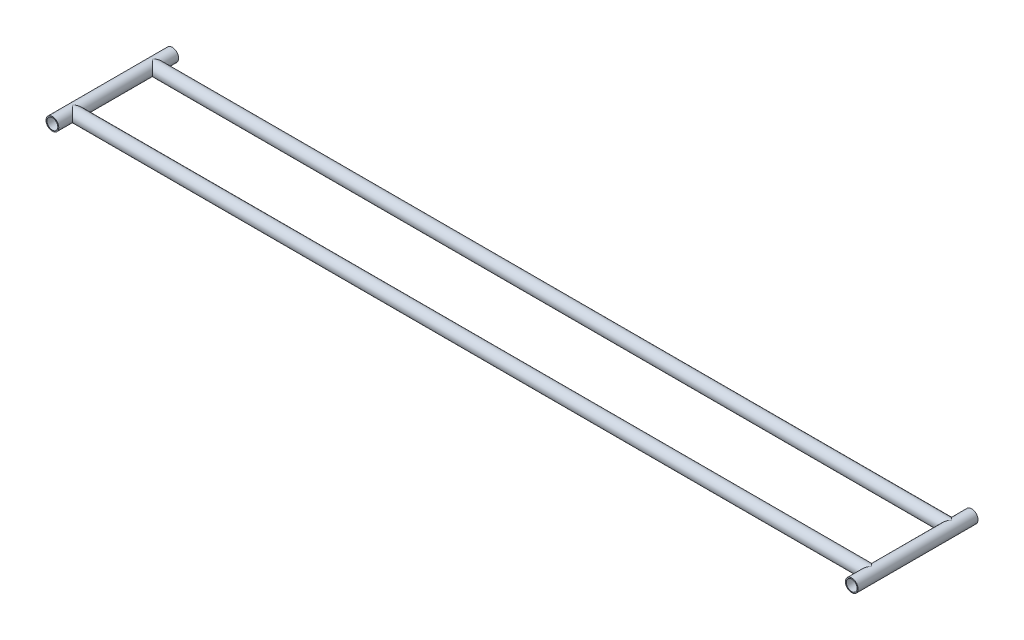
ISO-10303-21;
HEADER;
FILE_DESCRIPTION(('STEP AP214'),'2;1');
FILE_NAME('part.step','',(''),(''),'','','');
FILE_SCHEMA(('AUTOMOTIVE_DESIGN { 1 0 10303 214 1 1 1 1 }'));
ENDSEC;
DATA;
#1=APPLICATION_CONTEXT('core data for automotive mechanical design processes');
#2=APPLICATION_PROTOCOL_DEFINITION('international standard','automotive_design',2000,#1);
#3=PRODUCT_CONTEXT('',#1,'mechanical');
#4=PRODUCT('Part','Part','',(#3));
#5=PRODUCT_RELATED_PRODUCT_CATEGORY('part','',(#4));
#6=PRODUCT_DEFINITION_FORMATION('','',#4);
#7=PRODUCT_DEFINITION_CONTEXT('part definition',#1,'design');
#8=PRODUCT_DEFINITION('design','',#6,#7);
#9=PRODUCT_DEFINITION_SHAPE('','',#8);
#10=(LENGTH_UNIT() NAMED_UNIT(*) SI_UNIT(.MILLI.,.METRE.));
#11=(NAMED_UNIT(*) PLANE_ANGLE_UNIT() SI_UNIT($,.RADIAN.));
#12=(NAMED_UNIT(*) SI_UNIT($,.STERADIAN.) SOLID_ANGLE_UNIT());
#13=UNCERTAINTY_MEASURE_WITH_UNIT(LENGTH_MEASURE(1.E-05),#10,'distance_accuracy_value','');
#14=(GEOMETRIC_REPRESENTATION_CONTEXT(3) GLOBAL_UNCERTAINTY_ASSIGNED_CONTEXT((#13)) GLOBAL_UNIT_ASSIGNED_CONTEXT((#10,
#11,#12)) REPRESENTATION_CONTEXT('',''));
#15=CARTESIAN_POINT('',(0.,0.,0.));
#16=DIRECTION('',(0.,0.,1.));
#17=DIRECTION('',(1.,0.,0.));
#18=AXIS2_PLACEMENT_3D('',#15,#16,#17);
#19=CARTESIAN_POINT('',(0.,0.,-75.));
#20=DIRECTION('',(0.,0.,1.));
#21=DIRECTION('',(1.,0.,0.));
#22=AXIS2_PLACEMENT_3D('',#19,#20,#21);
#23=CYLINDRICAL_SURFACE('',#22,8.);
#24=CARTESIAN_POINT('',(0.,0.,75.));
#25=DIRECTION('',(0.,0.,1.));
#26=DIRECTION('',(1.,0.,0.));
#27=AXIS2_PLACEMENT_3D('',#24,#25,#26);
#28=CIRCLE('',#27,8.);
#29=CARTESIAN_POINT('',(8.,0.,75.));
#30=VERTEX_POINT('',#29);
#31=EDGE_CURVE('E170',#30,#30,#28,.T.);
#32=ORIENTED_EDGE('',*,*,#31,.F.);
#33=EDGE_LOOP('',(#32));
#34=FACE_BOUND('',#33,.T.);
#35=CARTESIAN_POINT('',(0.,0.,-75.));
#36=DIRECTION('',(0.,0.,1.));
#37=DIRECTION('',(1.,0.,0.));
#38=AXIS2_PLACEMENT_3D('',#35,#36,#37);
#39=CIRCLE('',#38,8.);
#40=CARTESIAN_POINT('',(8.,0.,-75.));
#41=VERTEX_POINT('',#40);
#42=EDGE_CURVE('E162',#41,#41,#39,.T.);
#43=ORIENTED_EDGE('',*,*,#42,.T.);
#44=EDGE_LOOP('',(#43));
#45=FACE_BOUND('',#44,.T.);
#46=CARTESIAN_POINT('',(0.,0.,50.));
#47=DIRECTION('',(-0.707106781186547,0.,0.707106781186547));
#48=DIRECTION('',(-0.707106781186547,0.,-0.707106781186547));
#49=AXIS2_PLACEMENT_3D('',#46,#47,#48);
#50=ELLIPSE('',#49,11.3137084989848,8.);
#51=CARTESIAN_POINT('',(0.,8.,50.));
#52=VERTEX_POINT('',#51);
#53=CARTESIAN_POINT('',(0.,-8.,50.));
#54=VERTEX_POINT('',#53);
#55=EDGE_CURVE('E154',#52,#54,#50,.F.);
#56=ORIENTED_EDGE('',*,*,#55,.F.);
#57=CARTESIAN_POINT('',(0.,0.,50.));
#58=DIRECTION('',(-0.707106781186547,0.,-0.707106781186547));
#59=DIRECTION('',(-0.707106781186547,0.,0.707106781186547));
#60=AXIS2_PLACEMENT_3D('',#57,#58,#59);
#61=ELLIPSE('',#60,11.3137084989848,8.);
#62=EDGE_CURVE('E158',#54,#52,#61,.F.);
#63=ORIENTED_EDGE('',*,*,#62,.F.);
#64=EDGE_LOOP('',(#56,#63));
#65=FACE_BOUND('',#64,.T.);
#66=CARTESIAN_POINT('',(0.,0.,-50.));
#67=DIRECTION('',(0.707106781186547,0.,0.707106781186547));
#68=DIRECTION('',(-0.707106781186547,0.,0.707106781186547));
#69=AXIS2_PLACEMENT_3D('',#66,#67,#68);
#70=ELLIPSE('',#69,11.3137084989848,8.);
#71=CARTESIAN_POINT('',(0.,8.,-50.));
#72=VERTEX_POINT('',#71);
#73=CARTESIAN_POINT('',(0.,-8.,-50.));
#74=VERTEX_POINT('',#73);
#75=EDGE_CURVE('E136',#72,#74,#70,.F.);
#76=ORIENTED_EDGE('',*,*,#75,.T.);
#77=CARTESIAN_POINT('',(0.,0.,-50.));
#78=DIRECTION('',(-0.707106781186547,0.,0.707106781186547));
#79=DIRECTION('',(0.707106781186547,0.,0.707106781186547));
#80=AXIS2_PLACEMENT_3D('',#77,#78,#79);
#81=ELLIPSE('',#80,11.3137084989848,8.);
#82=EDGE_CURVE('E177',#74,#72,#81,.T.);
#83=ORIENTED_EDGE('',*,*,#82,.T.);
#84=EDGE_LOOP('',(#76,#83));
#85=FACE_BOUND('',#84,.T.);
#86=ADVANCED_FACE('F42',(#34,#45,#65,#85),#23,.T.);
#87=CARTESIAN_POINT('',(1000.,0.,50.));
#88=DIRECTION('',(-1.,0.,0.));
#89=DIRECTION('',(0.,0.,1.));
#90=AXIS2_PLACEMENT_3D('',#87,#88,#89);
#91=CYLINDRICAL_SURFACE('',#90,8.);
#92=CARTESIAN_POINT('',(1000.,0.,50.));
#93=DIRECTION('',(-0.707106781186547,0.,-0.707106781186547));
#94=DIRECTION('',(-0.707106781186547,0.,0.707106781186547));
#95=AXIS2_PLACEMENT_3D('',#92,#93,#94);
#96=ELLIPSE('',#95,11.3137084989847,7.99999999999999);
#97=CARTESIAN_POINT('',(1000.,-7.99999999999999,50.));
#98=VERTEX_POINT('',#97);
#99=CARTESIAN_POINT('',(1000.,7.99999999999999,50.));
#100=VERTEX_POINT('',#99);
#101=EDGE_CURVE('E97',#98,#100,#96,.T.);
#102=ORIENTED_EDGE('',*,*,#101,.T.);
#103=CARTESIAN_POINT('',(1000.,0.,50.));
#104=DIRECTION('',(-0.707106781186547,0.,0.707106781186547));
#105=DIRECTION('',(-0.707106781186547,0.,-0.707106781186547));
#106=AXIS2_PLACEMENT_3D('',#103,#104,#105);
#107=ELLIPSE('',#106,11.3137084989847,7.99999999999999);
#108=EDGE_CURVE('E64',#100,#98,#107,.T.);
#109=ORIENTED_EDGE('',*,*,#108,.T.);
#110=EDGE_LOOP('',(#102,#109));
#111=FACE_BOUND('',#110,.T.);
#112=ORIENTED_EDGE('',*,*,#62,.T.);
#113=ORIENTED_EDGE('',*,*,#55,.T.);
#114=EDGE_LOOP('',(#112,#113));
#115=FACE_BOUND('',#114,.T.);
#116=ADVANCED_FACE('F44',(#111,#115),#91,.T.);
#117=CARTESIAN_POINT('',(0.,0.,-75.));
#118=DIRECTION('',(0.,0.,1.));
#119=DIRECTION('',(1.,0.,0.));
#120=AXIS2_PLACEMENT_3D('',#117,#118,#119);
#121=PLANE('',#120);
#122=CARTESIAN_POINT('',(0.,0.,-75.));
#123=DIRECTION('',(0.,0.,1.));
#124=DIRECTION('',(1.,0.,0.));
#125=AXIS2_PLACEMENT_3D('',#122,#123,#124);
#126=CIRCLE('',#125,6.75);
#127=CARTESIAN_POINT('',(6.75,0.,-75.));
#128=VERTEX_POINT('',#127);
#129=EDGE_CURVE('E166',#128,#128,#126,.T.);
#130=ORIENTED_EDGE('',*,*,#129,.T.);
#131=EDGE_LOOP('',(#130));
#132=FACE_BOUND('',#131,.T.);
#133=ORIENTED_EDGE('',*,*,#42,.F.);
#134=EDGE_LOOP('',(#133));
#135=FACE_BOUND('',#134,.T.);
#136=ADVANCED_FACE('F145',(#132,#135),#121,.F.);
#137=CARTESIAN_POINT('',(0.,0.,75.));
#138=DIRECTION('',(0.,0.,1.));
#139=DIRECTION('',(1.,0.,0.));
#140=AXIS2_PLACEMENT_3D('',#137,#138,#139);
#141=PLANE('',#140);
#142=ORIENTED_EDGE('',*,*,#31,.T.);
#143=EDGE_LOOP('',(#142));
#144=FACE_BOUND('',#143,.T.);
#145=CARTESIAN_POINT('',(0.,0.,75.));
#146=DIRECTION('',(0.,0.,1.));
#147=DIRECTION('',(1.,0.,0.));
#148=AXIS2_PLACEMENT_3D('',#145,#146,#147);
#149=CIRCLE('',#148,6.75);
#150=CARTESIAN_POINT('',(6.75,0.,75.));
#151=VERTEX_POINT('',#150);
#152=EDGE_CURVE('E174',#151,#151,#149,.T.);
#153=ORIENTED_EDGE('',*,*,#152,.F.);
#154=EDGE_LOOP('',(#153));
#155=FACE_BOUND('',#154,.T.);
#156=ADVANCED_FACE('F269',(#144,#155),#141,.T.);
#157=CARTESIAN_POINT('',(1000.,0.,-50.));
#158=DIRECTION('',(-1.,0.,0.));
#159=DIRECTION('',(0.,0.,1.));
#160=AXIS2_PLACEMENT_3D('',#157,#158,#159);
#161=CYLINDRICAL_SURFACE('',#160,8.);
#162=ORIENTED_EDGE('',*,*,#82,.F.);
#163=ORIENTED_EDGE('',*,*,#75,.F.);
#164=EDGE_LOOP('',(#162,#163));
#165=FACE_BOUND('',#164,.T.);
#166=CARTESIAN_POINT('',(1000.,0.,-50.));
#167=DIRECTION('',(-0.707106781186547,0.,-0.707106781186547));
#168=DIRECTION('',(-0.707106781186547,0.,0.707106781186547));
#169=AXIS2_PLACEMENT_3D('',#166,#167,#168);
#170=ELLIPSE('',#169,11.3137084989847,7.99999999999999);
#171=CARTESIAN_POINT('',(1000.,-7.99999999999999,-50.));
#172=VERTEX_POINT('',#171);
#173=CARTESIAN_POINT('',(1000.,7.99999999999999,-50.));
#174=VERTEX_POINT('',#173);
#175=EDGE_CURVE('E88',#172,#174,#170,.T.);
#176=ORIENTED_EDGE('',*,*,#175,.T.);
#177=CARTESIAN_POINT('',(1000.,0.,-50.));
#178=DIRECTION('',(-0.707106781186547,0.,0.707106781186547));
#179=DIRECTION('',(-0.707106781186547,0.,-0.707106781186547));
#180=AXIS2_PLACEMENT_3D('',#177,#178,#179);
#181=ELLIPSE('',#180,11.3137084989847,7.99999999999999);
#182=EDGE_CURVE('E71',#174,#172,#181,.T.);
#183=ORIENTED_EDGE('',*,*,#182,.T.);
#184=EDGE_LOOP('',(#176,#183));
#185=FACE_BOUND('',#184,.T.);
#186=ADVANCED_FACE('F95',(#165,#185),#161,.T.);
#187=CARTESIAN_POINT('',(0.,0.,-75.));
#188=DIRECTION('',(0.,0.,1.));
#189=DIRECTION('',(1.,0.,0.));
#190=AXIS2_PLACEMENT_3D('',#187,#188,#189);
#191=CYLINDRICAL_SURFACE('',#190,6.75);
#192=ORIENTED_EDGE('',*,*,#152,.T.);
#193=EDGE_LOOP('',(#192));
#194=FACE_BOUND('',#193,.T.);
#195=ORIENTED_EDGE('',*,*,#129,.F.);
#196=EDGE_LOOP('',(#195));
#197=FACE_BOUND('',#196,.T.);
#198=ADVANCED_FACE('F255',(#194,#197),#191,.F.);
#199=CARTESIAN_POINT('',(1000.,0.,75.));
#200=DIRECTION('',(0.,0.,1.));
#201=DIRECTION('',(1.,0.,0.));
#202=AXIS2_PLACEMENT_3D('',#199,#200,#201);
#203=PLANE('',#202);
#204=CARTESIAN_POINT('',(1000.,0.,75.));
#205=DIRECTION('',(0.,0.,1.));
#206=DIRECTION('',(1.,0.,0.));
#207=AXIS2_PLACEMENT_3D('',#204,#205,#206);
#208=CIRCLE('',#207,7.99999999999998);
#209=CARTESIAN_POINT('',(1008.,0.,75.));
#210=VERTEX_POINT('',#209);
#211=EDGE_CURVE('E332',#210,#210,#208,.T.);
#212=ORIENTED_EDGE('',*,*,#211,.T.);
#213=EDGE_LOOP('',(#212));
#214=FACE_BOUND('',#213,.T.);
#215=CARTESIAN_POINT('',(1000.,0.,75.));
#216=DIRECTION('',(0.,0.,1.));
#217=DIRECTION('',(1.,0.,0.));
#218=AXIS2_PLACEMENT_3D('',#215,#216,#217);
#219=CIRCLE('',#218,6.75000000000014);
#220=CARTESIAN_POINT('',(1006.75,0.,75.));
#221=VERTEX_POINT('',#220);
#222=EDGE_CURVE('E335',#221,#221,#219,.T.);
#223=ORIENTED_EDGE('',*,*,#222,.F.);
#224=EDGE_LOOP('',(#223));
#225=FACE_BOUND('',#224,.T.);
#226=ADVANCED_FACE('F248',(#214,#225),#203,.T.);
#227=CARTESIAN_POINT('',(1000.,0.,-75.));
#228=DIRECTION('',(0.,0.,1.));
#229=DIRECTION('',(1.,0.,0.));
#230=AXIS2_PLACEMENT_3D('',#227,#228,#229);
#231=PLANE('',#230);
#232=CARTESIAN_POINT('',(1000.,0.,-75.));
#233=DIRECTION('',(0.,0.,1.));
#234=DIRECTION('',(1.,0.,0.));
#235=AXIS2_PLACEMENT_3D('',#232,#233,#234);
#236=CIRCLE('',#235,6.75000000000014);
#237=CARTESIAN_POINT('',(1006.75,0.,-75.));
#238=VERTEX_POINT('',#237);
#239=EDGE_CURVE('E340',#238,#238,#236,.T.);
#240=ORIENTED_EDGE('',*,*,#239,.T.);
#241=EDGE_LOOP('',(#240));
#242=FACE_BOUND('',#241,.T.);
#243=CARTESIAN_POINT('',(1000.,0.,-75.));
#244=DIRECTION('',(0.,0.,1.));
#245=DIRECTION('',(1.,0.,0.));
#246=AXIS2_PLACEMENT_3D('',#243,#244,#245);
#247=CIRCLE('',#246,7.99999999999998);
#248=CARTESIAN_POINT('',(1008.,0.,-75.));
#249=VERTEX_POINT('',#248);
#250=EDGE_CURVE('E93',#249,#249,#247,.T.);
#251=ORIENTED_EDGE('',*,*,#250,.F.);
#252=EDGE_LOOP('',(#251));
#253=FACE_BOUND('',#252,.T.);
#254=ADVANCED_FACE('F117',(#242,#253),#231,.F.);
#255=CARTESIAN_POINT('',(1000.,0.,-75.));
#256=DIRECTION('',(0.,0.,1.));
#257=DIRECTION('',(1.,0.,0.));
#258=AXIS2_PLACEMENT_3D('',#255,#256,#257);
#259=CYLINDRICAL_SURFACE('',#258,6.75000000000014);
#260=ORIENTED_EDGE('',*,*,#239,.F.);
#261=EDGE_LOOP('',(#260));
#262=FACE_BOUND('',#261,.T.);
#263=ORIENTED_EDGE('',*,*,#222,.T.);
#264=EDGE_LOOP('',(#263));
#265=FACE_BOUND('',#264,.T.);
#266=ADVANCED_FACE('F187',(#262,#265),#259,.F.);
#267=CARTESIAN_POINT('',(1000.,0.,-75.));
#268=DIRECTION('',(0.,0.,1.));
#269=DIRECTION('',(1.,0.,0.));
#270=AXIS2_PLACEMENT_3D('',#267,#268,#269);
#271=CYLINDRICAL_SURFACE('',#270,7.99999999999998);
#272=ORIENTED_EDGE('',*,*,#182,.F.);
#273=ORIENTED_EDGE('',*,*,#175,.F.);
#274=EDGE_LOOP('',(#272,#273));
#275=FACE_BOUND('',#274,.T.);
#276=ORIENTED_EDGE('',*,*,#250,.T.);
#277=EDGE_LOOP('',(#276));
#278=FACE_BOUND('',#277,.T.);
#279=ORIENTED_EDGE('',*,*,#211,.F.);
#280=EDGE_LOOP('',(#279));
#281=FACE_BOUND('',#280,.T.);
#282=ORIENTED_EDGE('',*,*,#108,.F.);
#283=ORIENTED_EDGE('',*,*,#101,.F.);
#284=EDGE_LOOP('',(#282,#283));
#285=FACE_BOUND('',#284,.T.);
#286=ADVANCED_FACE('F89',(#275,#278,#281,#285),#271,.T.);
#287=CLOSED_SHELL('',(#86,#116,#136,#156,#186,#198,#226,#254,#266,#286));
#288=CARTESIAN_POINT('',(992.,0.,-43.25));
#289=CARTESIAN_POINT('',(992.000001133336,0.159591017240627,-43.2500011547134));
#290=CARTESIAN_POINT('',(992.004786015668,0.319202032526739,-43.2556702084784));
#291=CARTESIAN_POINT('',(992.023819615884,0.637125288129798,-43.2782450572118));
#292=CARTESIAN_POINT('',(992.038073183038,0.79543682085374,-43.2951566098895));
#293=CARTESIAN_POINT('',(992.075748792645,1.1096479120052,-43.3399396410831));
#294=CARTESIAN_POINT('',(992.099185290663,1.2655432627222,-43.3678283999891));
#295=CARTESIAN_POINT('',(992.154723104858,1.57357617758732,-43.4340883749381));
#296=CARTESIAN_POINT('',(992.186828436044,1.72571196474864,-43.4724644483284));
#297=CARTESIAN_POINT('',(992.258790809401,2.02412011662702,-43.5587745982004));
#298=CARTESIAN_POINT('',(992.298590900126,2.17042657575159,-43.6066385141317));
#299=CARTESIAN_POINT('',(992.385356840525,2.45759062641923,-43.7114272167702));
#300=CARTESIAN_POINT('',(992.432325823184,2.59844580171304,-43.7683559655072));
#301=CARTESIAN_POINT('',(992.582800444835,3.01179790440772,-43.9516723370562));
#302=CARTESIAN_POINT('',(992.695946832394,3.27537479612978,-44.0906768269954));
#303=CARTESIAN_POINT('',(992.90289261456,3.69700063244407,-44.3488618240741));
#304=CARTESIAN_POINT('',(992.991669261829,3.86226494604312,-44.460637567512));
#305=CARTESIAN_POINT('',(993.176308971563,4.17982270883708,-44.6961698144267));
#306=CARTESIAN_POINT('',(993.272171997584,4.33211622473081,-44.8199262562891));
#307=CARTESIAN_POINT('',(993.469285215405,4.62394560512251,-45.0786403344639));
#308=CARTESIAN_POINT('',(993.570549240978,4.76344594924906,-45.2136272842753));
#309=CARTESIAN_POINT('',(993.776258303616,5.02924115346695,-45.4937261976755));
#310=CARTESIAN_POINT('',(993.880702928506,5.15553771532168,-45.6388368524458));
#311=CARTESIAN_POINT('',(994.092733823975,5.39727165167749,-45.9416484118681));
#312=CARTESIAN_POINT('',(994.200341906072,5.51245387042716,-46.0995376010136));
#313=CARTESIAN_POINT('',(994.41427567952,5.72912374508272,-46.4253749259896));
#314=CARTESIAN_POINT('',(994.520600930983,5.83060681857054,-46.5933264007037));
#315=CARTESIAN_POINT('',(994.728650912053,6.01934736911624,-46.9391713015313));
#316=CARTESIAN_POINT('',(994.830385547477,6.10663665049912,-47.117041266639));
#317=CARTESIAN_POINT('',(995.02543931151,6.26654849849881,-47.4834875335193));
#318=CARTESIAN_POINT('',(995.118765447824,6.33918334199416,-47.6720547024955));
#319=CARTESIAN_POINT('',(995.298427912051,6.47369623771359,-48.0758454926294));
#320=CARTESIAN_POINT('',(995.383674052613,6.53431676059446,-48.2920037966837));
#321=CARTESIAN_POINT('',(995.4927550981,6.60959287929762,-48.6256782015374));
#322=CARTESIAN_POINT('',(995.525969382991,6.63206676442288,-48.7384034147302));
#323=CARTESIAN_POINT('',(995.584911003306,6.6714497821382,-48.9667224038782));
#324=CARTESIAN_POINT('',(995.610642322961,6.68836187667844,-49.0823146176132));
#325=CARTESIAN_POINT('',(995.653757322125,6.71646138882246,-49.3174617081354));
#326=CARTESIAN_POINT('',(995.671018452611,6.727564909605,-49.4370494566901));
#327=CARTESIAN_POINT('',(995.695689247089,6.74337656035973,-49.6776619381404));
#328=CARTESIAN_POINT('',(995.703100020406,6.748085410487,-49.7986865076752));
#329=CARTESIAN_POINT('',(995.70762110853,6.75096227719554,-50.0409653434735));
#330=CARTESIAN_POINT('',(995.704735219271,6.74913270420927,-50.1622195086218));
#331=CARTESIAN_POINT('',(995.688850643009,6.73899673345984,-50.403787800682));
#332=CARTESIAN_POINT('',(995.675850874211,6.7306896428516,-50.5241018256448));
#333=CARTESIAN_POINT('',(995.63954797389,6.70723071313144,-50.7690870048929));
#334=CARTESIAN_POINT('',(995.615732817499,6.69173779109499,-50.893648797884));
#335=CARTESIAN_POINT('',(995.559041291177,6.65424992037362,-51.1397257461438));
#336=CARTESIAN_POINT('',(995.526158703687,6.63225050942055,-51.2612387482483));
#337=CARTESIAN_POINT('',(995.416030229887,6.55706259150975,-51.6209650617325));
#338=CARTESIAN_POINT('',(995.327393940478,6.49473849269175,-51.8538339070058));
#339=CARTESIAN_POINT('',(995.150159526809,6.3630819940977,-52.2605894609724));
#340=CARTESIAN_POINT('',(995.064835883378,6.29740573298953,-52.4372034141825));
#341=CARTESIAN_POINT('',(994.886250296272,6.15327019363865,-52.7810979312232));
#342=CARTESIAN_POINT('',(994.792983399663,6.07480291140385,-52.9483725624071));
#343=CARTESIAN_POINT('',(994.601839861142,5.90560719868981,-53.2741489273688));
#344=CARTESIAN_POINT('',(994.503956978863,5.81486184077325,-53.4326381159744));
#345=CARTESIAN_POINT('',(994.306330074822,5.62149790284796,-53.7409018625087));
#346=CARTESIAN_POINT('',(994.206586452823,5.51888184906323,-53.890678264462));
#347=CARTESIAN_POINT('',(994.001053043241,5.29501293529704,-54.1907702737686));
#348=CARTESIAN_POINT('',(993.895278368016,5.17299311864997,-54.3405249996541));
#349=CARTESIAN_POINT('',(993.686175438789,4.91559996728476,-54.6299983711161));
#350=CARTESIAN_POINT('',(993.582847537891,4.78022471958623,-54.7697155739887));
#351=CARTESIAN_POINT('',(993.380864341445,4.4963690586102,-55.0381796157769));
#352=CARTESIAN_POINT('',(993.282200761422,4.34791333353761,-55.1669462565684));
#353=CARTESIAN_POINT('',(993.091305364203,4.03770916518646,-55.4128143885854));
#354=CARTESIAN_POINT('',(992.99907377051,3.8759602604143,-55.5299154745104));
#355=CARTESIAN_POINT('',(992.84217025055,3.57597372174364,-55.7271083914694));
#356=CARTESIAN_POINT('',(992.775859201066,3.44024410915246,-55.809719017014));
#357=CARTESIAN_POINT('',(992.649426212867,3.16109626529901,-55.9662015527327));
#358=CARTESIAN_POINT('',(992.589302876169,3.01767978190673,-56.0400754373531));
#359=CARTESIAN_POINT('',(992.476240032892,2.72357368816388,-56.1782717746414));
#360=CARTESIAN_POINT('',(992.423300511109,2.57288409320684,-56.2425942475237));
#361=CARTESIAN_POINT('',(992.325622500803,2.26495124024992,-56.3607921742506));
#362=CARTESIAN_POINT('',(992.280880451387,2.10771086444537,-56.414672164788));
#363=CARTESIAN_POINT('',(992.200152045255,1.78608544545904,-56.5115938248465));
#364=CARTESIAN_POINT('',(992.164247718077,1.62164901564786,-56.5545340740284));
#365=CARTESIAN_POINT('',(992.10257242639,1.28817084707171,-56.6281419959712));
#366=CARTESIAN_POINT('',(992.076801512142,1.11912908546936,-56.6588096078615));
#367=CARTESIAN_POINT('',(992.036072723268,0.778035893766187,-56.7072206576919));
#368=CARTESIAN_POINT('',(992.021106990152,0.605986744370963,-56.7249734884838));
#369=CARTESIAN_POINT('',(992.002369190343,0.260435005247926,-56.7471946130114));
#370=CARTESIAN_POINT('',(991.998595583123,0.0869326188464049,-56.7516647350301));
#371=CARTESIAN_POINT('',(992.002085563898,-0.236386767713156,-56.747527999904));
#372=CARTESIAN_POINT('',(992.007930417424,-0.386245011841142,-56.7406020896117));
#373=CARTESIAN_POINT('',(992.027948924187,-0.684666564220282,-56.7168548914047));
#374=CARTESIAN_POINT('',(992.042125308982,-0.833229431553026,-56.7000303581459));
#375=CARTESIAN_POINT('',(992.078515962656,-1.12788412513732,-56.6567669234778));
#376=CARTESIAN_POINT('',(992.10072725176,-1.27397684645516,-56.630331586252));
#377=CARTESIAN_POINT('',(992.152768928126,-1.56285544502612,-56.5682434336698));
#378=CARTESIAN_POINT('',(992.182602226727,-1.7056400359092,-56.5325870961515));
#379=CARTESIAN_POINT('',(992.249123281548,-1.98608454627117,-56.4528343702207));
#380=CARTESIAN_POINT('',(992.285762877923,-2.12377278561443,-56.4087972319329));
#381=CARTESIAN_POINT('',(992.365430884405,-2.3944289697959,-56.3126748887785));
#382=CARTESIAN_POINT('',(992.408461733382,-2.52739508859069,-56.260586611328));
#383=CARTESIAN_POINT('',(992.546203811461,-2.91841454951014,-56.0930822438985));
#384=CARTESIAN_POINT('',(992.649599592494,-3.1687325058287,-55.9663850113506));
#385=CARTESIAN_POINT('',(992.842672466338,-3.57894482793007,-55.7265495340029));
#386=CARTESIAN_POINT('',(992.928107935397,-3.74455915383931,-55.6195174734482));
#387=CARTESIAN_POINT('',(993.106336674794,-4.06333829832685,-55.3935083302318));
#388=CARTESIAN_POINT('',(993.199132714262,-4.21649838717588,-55.2745267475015));
#389=CARTESIAN_POINT('',(993.390397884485,-4.51043181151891,-55.0255067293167));
#390=CARTESIAN_POINT('',(993.488879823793,-4.65117521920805,-54.8954429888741));
#391=CARTESIAN_POINT('',(993.689450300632,-4.91986347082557,-54.6253352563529));
#392=CARTESIAN_POINT('',(993.791538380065,-5.04780993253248,-54.4852925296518));
#393=CARTESIAN_POINT('',(993.999295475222,-5.29318955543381,-54.1930565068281));
#394=CARTESIAN_POINT('',(994.10499582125,-5.41038630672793,-54.040687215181));
#395=CARTESIAN_POINT('',(994.315916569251,-5.63156687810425,-53.7262471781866));
#396=CARTESIAN_POINT('',(994.421136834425,-5.73554713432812,-53.5641738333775));
#397=CARTESIAN_POINT('',(994.62819239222,-5.92990655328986,-53.2304704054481));
#398=CARTESIAN_POINT('',(994.730033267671,-6.02030911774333,-53.0588574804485));
#399=CARTESIAN_POINT('',(994.927000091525,-6.18719026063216,-52.7054255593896));
#400=CARTESIAN_POINT('',(995.022130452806,-6.26367804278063,-52.5236134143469));
#401=CARTESIAN_POINT('',(995.213343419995,-6.41126770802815,-52.1235904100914));
#402=CARTESIAN_POINT('',(995.307803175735,-6.4802299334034,-51.9037883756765));
#403=CARTESIAN_POINT('',(995.472801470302,-6.59657200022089,-51.4499040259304));
#404=CARTESIAN_POINT('',(995.543393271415,-6.64399997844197,-51.2158549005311));
#405=CARTESIAN_POINT('',(995.619200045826,-6.69397616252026,-50.874014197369));
#406=CARTESIAN_POINT('',(995.638693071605,-6.70666511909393,-50.7707727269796));
#407=CARTESIAN_POINT('',(995.670605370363,-6.72731070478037,-50.5627540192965));
#408=CARTESIAN_POINT('',(995.683027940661,-6.73526953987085,-50.4579775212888));
#409=CARTESIAN_POINT('',(995.700252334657,-6.74627863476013,-50.2476135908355));
#410=CARTESIAN_POINT('',(995.705059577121,-6.7493323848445,-50.1420267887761));
#411=CARTESIAN_POINT('',(995.70684997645,-6.75047140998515,-49.9307571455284));
#412=CARTESIAN_POINT('',(995.70383299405,-6.74855659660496,-49.8250743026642));
#413=CARTESIAN_POINT('',(995.690126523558,-6.73981125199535,-49.6146286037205));
#414=CARTESIAN_POINT('',(995.679452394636,-6.73299056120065,-49.5098643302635));
#415=CARTESIAN_POINT('',(995.650926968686,-6.71459948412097,-49.3017241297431));
#416=CARTESIAN_POINT('',(995.633072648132,-6.70302709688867,-49.1983488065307));
#417=CARTESIAN_POINT('',(995.569721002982,-6.66147141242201,-48.8909388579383));
#418=CARTESIAN_POINT('',(995.514446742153,-6.62465648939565,-48.6897744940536));
#419=CARTESIAN_POINT('',(995.397037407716,-6.54345346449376,-48.3349485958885));
#420=CARTESIAN_POINT('',(995.338174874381,-6.50181283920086,-48.1794962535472));
#421=CARTESIAN_POINT('',(995.211190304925,-6.40886109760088,-47.8753169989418));
#422=CARTESIAN_POINT('',(995.143062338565,-6.35754377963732,-47.726594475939));
#423=CARTESIAN_POINT('',(995.000123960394,-6.24575831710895,-47.4353504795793));
#424=CARTESIAN_POINT('',(994.925292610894,-6.18526106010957,-47.2928506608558));
#425=CARTESIAN_POINT('',(994.77135799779,-6.05569443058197,-47.0142582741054));
#426=CARTESIAN_POINT('',(994.692255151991,-5.9866258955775,-46.8781650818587));
#427=CARTESIAN_POINT('',(994.497943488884,-5.80957003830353,-46.5564861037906));
#428=CARTESIAN_POINT('',(994.381455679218,-5.69737766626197,-46.3739743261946));
#429=CARTESIAN_POINT('',(994.147312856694,-5.45658345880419,-46.0208201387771));
#430=CARTESIAN_POINT('',(994.02965738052,-5.32797484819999,-45.8501826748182));
#431=CARTESIAN_POINT('',(993.796521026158,-5.0546099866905,-45.5212640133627));
#432=CARTESIAN_POINT('',(993.681037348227,-4.90987646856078,-45.3629659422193));
#433=CARTESIAN_POINT('',(993.454904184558,-4.60411321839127,-45.0592472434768));
#434=CARTESIAN_POINT('',(993.344252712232,-4.44309027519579,-44.9138212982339));
#435=CARTESIAN_POINT('',(993.155823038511,-4.14494170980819,-44.6699221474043));
#436=CARTESIAN_POINT('',(993.076475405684,-4.0112139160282,-44.5684967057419));
#437=CARTESIAN_POINT('',(992.923342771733,-3.73442414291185,-44.3746008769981));
#438=CARTESIAN_POINT('',(992.849556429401,-3.59136442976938,-44.2821283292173));
#439=CARTESIAN_POINT('',(992.708817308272,-3.29626440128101,-44.1070762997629));
#440=CARTESIAN_POINT('',(992.641859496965,-3.14423083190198,-44.0244895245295));
#441=CARTESIAN_POINT('',(992.51597942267,-2.83157492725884,-43.8701502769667));
#442=CARTESIAN_POINT('',(992.457055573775,-2.67095429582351,-43.798395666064));
#443=CARTESIAN_POINT('',(992.357395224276,-2.36887702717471,-43.6775896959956));
#444=CARTESIAN_POINT('',(992.315260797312,-2.2285970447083,-43.6267449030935));
#445=CARTESIAN_POINT('',(992.238181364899,-1.94319525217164,-43.5340125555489));
#446=CARTESIAN_POINT('',(992.203234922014,-1.79807441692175,-43.4921232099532));
#447=CARTESIAN_POINT('',(992.141224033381,-1.50405136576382,-43.417958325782));
#448=CARTESIAN_POINT('',(992.114144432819,-1.35515702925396,-43.3856642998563));
#449=CARTESIAN_POINT('',(992.06832230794,-1.054332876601,-43.3310997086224));
#450=CARTESIAN_POINT('',(992.049575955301,-0.902404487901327,-43.3088245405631));
#451=CARTESIAN_POINT('',(992.023514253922,-0.625463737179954,-43.2778813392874));
#452=CARTESIAN_POINT('',(992.014708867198,-0.500785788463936,-43.2674381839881));
#453=CARTESIAN_POINT('',(992.002950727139,-0.250742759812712,-43.2534963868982));
#454=CARTESIAN_POINT('',(991.999999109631,-0.125377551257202,-43.2499990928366));
#455=CARTESIAN_POINT('',(992.,0.,-43.25));
#456=B_SPLINE_CURVE_WITH_KNOTS('',3,(#288,#289,#290,#291,#292,#293,#294,#295,#296,#297,#298,
#299,#300,#301,#302,#303,#304,#305,#306,#307,#308,#309,#310,#311,#312,#313,#314,#315,#316,#317,
#318,#319,#320,#321,#322,#323,#324,#325,#326,#327,#328,#329,#330,#331,#332,#333,#334,#335,#336,
#337,#338,#339,#340,#341,#342,#343,#344,#345,#346,#347,#348,#349,#350,#351,#352,#353,#354,#355,
#356,#357,#358,#359,#360,#361,#362,#363,#364,#365,#366,#367,#368,#369,#370,#371,#372,#373,#374,
#375,#376,#377,#378,#379,#380,#381,#382,#383,#384,#385,#386,#387,#388,#389,#390,#391,#392,#393,
#394,#395,#396,#397,#398,#399,#400,#401,#402,#403,#404,#405,#406,#407,#408,#409,#410,#411,#412,
#413,#414,#415,#416,#417,#418,#419,#420,#421,#422,#423,#424,#425,#426,#427,#428,#429,#430,#431,
#432,#433,#434,#435,#436,#437,#438,#439,#440,#441,#442,#443,#444,#445,#446,#447,#448,#449,#450,
#451,#452,#453,#454,#455),.UNSPECIFIED.,.T.,.F.,(4,2,2,2,2,2,2,2,2,2,2,2,2,2,2,2,2,2,2,2,2,2,2,
2,2,2,2,2,2,2,2,2,2,2,2,2,2,2,2,2,2,2,2,2,2,2,2,2,2,2,2,2,2,2,2,2,2,2,2,2,2,2,2,2,2,2,2,2,2,2,2,
2,2,2,2,2,2,2,2,2,2,2,2,4),(0.,0.478637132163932,0.957519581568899,1.43715892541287,
1.91702079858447,2.39345835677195,2.87010472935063,3.82246390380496,4.47685460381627,
5.13124193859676,5.78739440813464,6.44346220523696,7.11213073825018,7.78102239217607,
8.4483939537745,9.11520407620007,9.83331615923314,10.1919302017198,10.5503529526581,
10.9138188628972,11.277243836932,11.6405348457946,12.0038647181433,12.3865513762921,
12.7695010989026,13.5370061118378,14.1568272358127,14.7770377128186,15.3981121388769,
16.0190546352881,16.6791296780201,17.3392994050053,17.998248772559,18.6572210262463,
19.1732898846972,19.6892418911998,20.2051928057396,20.720919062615,21.2412655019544,
21.7616145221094,22.2815847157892,22.8014833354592,23.2513260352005,23.7013163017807,
24.1511398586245,24.601135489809,25.0480606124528,25.4951567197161,26.3888929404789,
27.0328563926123,27.6770632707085,28.3227827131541,28.9684204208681,29.6259229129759,
30.2836023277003,30.9401348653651,31.5962315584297,32.3413682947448,33.0848310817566,
33.4020250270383,33.7190709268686,34.0358911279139,34.3527169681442,34.6689090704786,
34.985234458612,35.6183444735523,36.1317648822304,36.6455154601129,37.1609307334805,
37.676295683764,38.406948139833,39.1379031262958,39.8678403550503,40.5974746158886,
41.1539492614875,41.7102892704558,42.2662162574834,42.8220333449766,43.2867047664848,
43.7512831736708,44.2149605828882,44.6784247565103,45.0543776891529,45.4304035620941),.UNSPECIFIED.);
#457=CARTESIAN_POINT('',(992.,0.,-43.25));
#458=VERTEX_POINT('',#457);
#459=EDGE_CURVE('E46',#458,#458,#456,.T.);
#460=ORIENTED_EDGE('',*,*,#459,.T.);
#461=EDGE_LOOP('',(#460));
#462=FACE_BOUND('',#461,.T.);
#463=ADVANCED_FACE('F109',(#462),#271,.T.);
#464=CARTESIAN_POINT('',(8.,0.,-56.75));
#465=CARTESIAN_POINT('',(7.99999886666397,-0.159591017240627,-56.7499988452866));
#466=CARTESIAN_POINT('',(7.99521398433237,-0.31920203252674,-56.7443297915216));
#467=CARTESIAN_POINT('',(7.976180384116,-0.637125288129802,-56.7217549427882));
#468=CARTESIAN_POINT('',(7.96192681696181,-0.795436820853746,-56.7048433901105));
#469=CARTESIAN_POINT('',(7.92425120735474,-1.1096479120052,-56.6600603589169));
#470=CARTESIAN_POINT('',(7.90081470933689,-1.2655432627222,-56.6321716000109));
#471=CARTESIAN_POINT('',(7.84527689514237,-1.57357617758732,-56.5659116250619));
#472=CARTESIAN_POINT('',(7.81317156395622,-1.72571196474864,-56.5275355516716));
#473=CARTESIAN_POINT('',(7.74120919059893,-2.02412011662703,-56.4412254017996));
#474=CARTESIAN_POINT('',(7.7014090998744,-2.17042657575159,-56.3933614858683));
#475=CARTESIAN_POINT('',(7.61464315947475,-2.45759062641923,-56.2885727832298));
#476=CARTESIAN_POINT('',(7.56767417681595,-2.59844580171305,-56.2316440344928));
#477=CARTESIAN_POINT('',(7.41719955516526,-3.01179790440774,-56.0483276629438));
#478=CARTESIAN_POINT('',(7.3040531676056,-3.27537479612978,-55.9093231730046));
#479=CARTESIAN_POINT('',(7.09710738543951,-3.69700063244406,-55.6511381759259));
#480=CARTESIAN_POINT('',(7.00833073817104,-3.86226494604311,-55.539362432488));
#481=CARTESIAN_POINT('',(6.82369102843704,-4.17982270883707,-55.3038301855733));
#482=CARTESIAN_POINT('',(6.72782800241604,-4.33211622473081,-55.180073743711));
#483=CARTESIAN_POINT('',(6.53071478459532,-4.62394560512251,-54.9213596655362));
#484=CARTESIAN_POINT('',(6.42945075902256,-4.76344594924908,-54.7863727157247));
#485=CARTESIAN_POINT('',(6.22374169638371,-5.02924115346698,-54.5062738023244));
#486=CARTESIAN_POINT('',(6.11929707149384,-5.15553771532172,-54.3611631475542));
#487=CARTESIAN_POINT('',(5.90726617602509,-5.39727165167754,-54.0583515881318));
#488=CARTESIAN_POINT('',(5.79965809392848,-5.51245387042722,-53.9004623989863));
#489=CARTESIAN_POINT('',(5.58572432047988,-5.72912374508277,-53.5746250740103));
#490=CARTESIAN_POINT('',(5.47939906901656,-5.83060681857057,-53.4066735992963));
#491=CARTESIAN_POINT('',(5.27134908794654,-6.01934736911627,-53.0608286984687));
#492=CARTESIAN_POINT('',(5.16961445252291,-6.10663665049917,-52.882958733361));
#493=CARTESIAN_POINT('',(4.97456068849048,-6.26654849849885,-52.5165124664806));
#494=CARTESIAN_POINT('',(4.88123455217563,-6.33918334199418,-52.3279452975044));
#495=CARTESIAN_POINT('',(4.70157208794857,-6.4736962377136,-51.9241545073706));
#496=CARTESIAN_POINT('',(4.6163259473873,-6.53431676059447,-51.7079962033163));
#497=CARTESIAN_POINT('',(4.50724490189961,-6.60959287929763,-51.3743217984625));
#498=CARTESIAN_POINT('',(4.47403061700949,-6.63206676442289,-51.2615965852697));
#499=CARTESIAN_POINT('',(4.41508899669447,-6.67144978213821,-51.0332775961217));
#500=CARTESIAN_POINT('',(4.38935767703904,-6.68836187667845,-50.9176853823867));
#501=CARTESIAN_POINT('',(4.34624267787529,-6.71646138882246,-50.6825382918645));
#502=CARTESIAN_POINT('',(4.32898154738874,-6.72756490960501,-50.5629505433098));
#503=CARTESIAN_POINT('',(4.30431075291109,-6.74337656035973,-50.3223380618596));
#504=CARTESIAN_POINT('',(4.29689997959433,-6.748085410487,-50.2013134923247));
#505=CARTESIAN_POINT('',(4.29237889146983,-6.75096227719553,-49.9590346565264));
#506=CARTESIAN_POINT('',(4.2952647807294,-6.74913270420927,-49.8377804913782));
#507=CARTESIAN_POINT('',(4.31114935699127,-6.73899673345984,-49.5962121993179));
#508=CARTESIAN_POINT('',(4.32414912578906,-6.7306896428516,-49.4758981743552));
#509=CARTESIAN_POINT('',(4.36045202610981,-6.70723071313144,-49.230912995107));
#510=CARTESIAN_POINT('',(4.3842671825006,-6.69173779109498,-49.1063512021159));
#511=CARTESIAN_POINT('',(4.44095870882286,-6.65424992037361,-48.8602742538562));
#512=CARTESIAN_POINT('',(4.4738412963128,-6.63225050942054,-48.7387612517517));
#513=CARTESIAN_POINT('',(4.58396977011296,-6.55706259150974,-48.3790349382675));
#514=CARTESIAN_POINT('',(4.6726060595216,-6.49473849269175,-48.1461660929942));
#515=CARTESIAN_POINT('',(4.84984047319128,-6.36308199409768,-47.7394105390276));
#516=CARTESIAN_POINT('',(4.93516411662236,-6.29740573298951,-47.5627965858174));
#517=CARTESIAN_POINT('',(5.11374970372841,-6.15327019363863,-47.2189020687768));
#518=CARTESIAN_POINT('',(5.20701660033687,-6.07480291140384,-47.0516274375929));
#519=CARTESIAN_POINT('',(5.39816013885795,-5.9056071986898,-46.7258510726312));
#520=CARTESIAN_POINT('',(5.49604302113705,-5.81486184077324,-46.5673618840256));
#521=CARTESIAN_POINT('',(5.69366992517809,-5.62149790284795,-46.2590981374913));
#522=CARTESIAN_POINT('',(5.79341354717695,-5.5188818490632,-46.109321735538));
#523=CARTESIAN_POINT('',(5.99894695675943,-5.29501293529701,-45.8092297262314));
#524=CARTESIAN_POINT('',(6.10472163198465,-5.17299311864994,-45.6594750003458));
#525=CARTESIAN_POINT('',(6.31382456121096,-4.91559996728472,-45.3700016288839));
#526=CARTESIAN_POINT('',(6.41715246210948,-4.78022471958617,-45.2302844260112));
#527=CARTESIAN_POINT('',(6.61913565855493,-4.49636905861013,-44.9618203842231));
#528=CARTESIAN_POINT('',(6.71779923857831,-4.34791333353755,-44.8330537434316));
#529=CARTESIAN_POINT('',(6.90869463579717,-4.03770916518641,-44.5871856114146));
#530=CARTESIAN_POINT('',(7.00092622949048,-3.87596026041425,-44.4700845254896));
#531=CARTESIAN_POINT('',(7.15782974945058,-3.57597372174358,-44.2728916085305));
#532=CARTESIAN_POINT('',(7.22414079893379,-3.4402441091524,-44.190280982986));
#533=CARTESIAN_POINT('',(7.35057378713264,-3.16109626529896,-44.0337984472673));
#534=CARTESIAN_POINT('',(7.41069712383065,-3.01767978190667,-43.9599245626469));
#535=CARTESIAN_POINT('',(7.5237599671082,-2.72357368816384,-43.8217282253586));
#536=CARTESIAN_POINT('',(7.57669948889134,-2.5728840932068,-43.7574057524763));
#537=CARTESIAN_POINT('',(7.67437749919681,-2.26495124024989,-43.6392078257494));
#538=CARTESIAN_POINT('',(7.71911954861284,-2.10771086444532,-43.585327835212));
#539=CARTESIAN_POINT('',(7.79984795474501,-1.786085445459,-43.4884061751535));
#540=CARTESIAN_POINT('',(7.83575228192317,-1.62164901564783,-43.4454659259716));
#541=CARTESIAN_POINT('',(7.89742757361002,-1.28817084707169,-43.3718580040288));
#542=CARTESIAN_POINT('',(7.92319848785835,-1.11912908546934,-43.3411903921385));
#543=CARTESIAN_POINT('',(7.96392727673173,-0.778035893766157,-43.2927793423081));
#544=CARTESIAN_POINT('',(7.97889300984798,-0.605986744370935,-43.2750265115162));
#545=CARTESIAN_POINT('',(7.99763080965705,-0.260435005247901,-43.2528053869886));
#546=CARTESIAN_POINT('',(8.00140441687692,-0.0869326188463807,-43.2483352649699));
#547=CARTESIAN_POINT('',(7.99791443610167,0.236386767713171,-43.252472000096));
#548=CARTESIAN_POINT('',(7.99206958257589,0.38624501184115,-43.2593979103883));
#549=CARTESIAN_POINT('',(7.97205107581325,0.684666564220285,-43.2831451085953));
#550=CARTESIAN_POINT('',(7.95787469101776,0.833229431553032,-43.2999696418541));
#551=CARTESIAN_POINT('',(7.92148403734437,1.12788412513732,-43.3432330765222));
#552=CARTESIAN_POINT('',(7.89927274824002,1.27397684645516,-43.369668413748));
#553=CARTESIAN_POINT('',(7.84723107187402,1.56285544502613,-43.4317565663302));
#554=CARTESIAN_POINT('',(7.81739777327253,1.70564003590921,-43.4674129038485));
#555=CARTESIAN_POINT('',(7.7508767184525,1.98608454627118,-43.5471656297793));
#556=CARTESIAN_POINT('',(7.71423712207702,2.12377278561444,-43.5912027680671));
#557=CARTESIAN_POINT('',(7.63456911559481,2.3944289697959,-43.6873251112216));
#558=CARTESIAN_POINT('',(7.59153826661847,2.52739508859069,-43.739413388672));
#559=CARTESIAN_POINT('',(7.45379618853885,2.91841454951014,-43.9069177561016));
#560=CARTESIAN_POINT('',(7.35040040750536,3.16873250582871,-44.0336149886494));
#561=CARTESIAN_POINT('',(7.15732753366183,3.5789448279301,-44.2734504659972));
#562=CARTESIAN_POINT('',(7.07189206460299,3.74455915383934,-44.3804825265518));
#563=CARTESIAN_POINT('',(6.89366332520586,4.06333829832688,-44.6064916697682));
#564=CARTESIAN_POINT('',(6.80086728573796,4.21649838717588,-44.7254732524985));
#565=CARTESIAN_POINT('',(6.60960211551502,4.51043181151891,-44.9744932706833));
#566=CARTESIAN_POINT('',(6.51112017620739,4.65117521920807,-45.1045570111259));
#567=CARTESIAN_POINT('',(6.31054969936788,4.9198634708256,-45.3746647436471));
#568=CARTESIAN_POINT('',(6.20846161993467,5.04780993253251,-45.5147074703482));
#569=CARTESIAN_POINT('',(6.0007045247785,5.29318955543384,-45.8069434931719));
#570=CARTESIAN_POINT('',(5.89500417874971,5.41038630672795,-45.9593127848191));
#571=CARTESIAN_POINT('',(5.68408343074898,5.63156687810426,-46.2737528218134));
#572=CARTESIAN_POINT('',(5.57886316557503,5.73554713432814,-46.4358261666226));
#573=CARTESIAN_POINT('',(5.37180760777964,5.92990655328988,-46.769529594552));
#574=CARTESIAN_POINT('',(5.26996673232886,6.02030911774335,-46.9411425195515));
#575=CARTESIAN_POINT('',(5.07299990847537,6.18719026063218,-47.2945744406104));
#576=CARTESIAN_POINT('',(4.97786954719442,6.26367804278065,-47.4763865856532));
#577=CARTESIAN_POINT('',(4.7866565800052,6.41126770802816,-47.8764095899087));
#578=CARTESIAN_POINT('',(4.69219682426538,6.48022993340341,-48.0962116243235));
#579=CARTESIAN_POINT('',(4.52719852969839,6.59657200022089,-48.5500959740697));
#580=CARTESIAN_POINT('',(4.45660672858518,6.64399997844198,-48.7841450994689));
#581=CARTESIAN_POINT('',(4.38079995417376,6.69397616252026,-49.1259858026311));
#582=CARTESIAN_POINT('',(4.3613069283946,6.70666511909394,-49.2292272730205));
#583=CARTESIAN_POINT('',(4.32939462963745,6.72731070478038,-49.4372459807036));
#584=CARTESIAN_POINT('',(4.31697205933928,6.73526953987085,-49.5420224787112));
#585=CARTESIAN_POINT('',(4.29974766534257,6.74627863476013,-49.7523864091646));
#586=CARTESIAN_POINT('',(4.29494042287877,6.7493323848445,-49.857973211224));
#587=CARTESIAN_POINT('',(4.29315002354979,6.75047140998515,-50.0692428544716));
#588=CARTESIAN_POINT('',(4.29616700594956,6.74855659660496,-50.1749256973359));
#589=CARTESIAN_POINT('',(4.30987347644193,6.73981125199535,-50.3853713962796));
#590=CARTESIAN_POINT('',(4.32054760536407,6.73299056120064,-50.4901356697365));
#591=CARTESIAN_POINT('',(4.34907303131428,6.71459948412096,-50.698275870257));
#592=CARTESIAN_POINT('',(4.36692735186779,6.70302709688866,-50.8016511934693));
#593=CARTESIAN_POINT('',(4.43027899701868,6.661471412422,-51.1090611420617));
#594=CARTESIAN_POINT('',(4.48555325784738,6.62465648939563,-51.3102255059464));
#595=CARTESIAN_POINT('',(4.60296259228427,6.54345346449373,-51.6650514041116));
#596=CARTESIAN_POINT('',(4.66182512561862,6.50181283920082,-51.820503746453));
#597=CARTESIAN_POINT('',(4.78880969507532,6.40886109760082,-52.1246830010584));
#598=CARTESIAN_POINT('',(4.85693766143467,6.35754377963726,-52.2734055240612));
#599=CARTESIAN_POINT('',(4.99987603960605,6.24575831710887,-52.5646495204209));
#600=CARTESIAN_POINT('',(5.07470738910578,6.18526106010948,-52.7071493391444));
#601=CARTESIAN_POINT('',(5.2286420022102,6.05569443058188,-52.9857417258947));
#602=CARTESIAN_POINT('',(5.30774484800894,5.98662589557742,-53.1218349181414));
#603=CARTESIAN_POINT('',(5.50205651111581,5.80957003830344,-53.4435138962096));
#604=CARTESIAN_POINT('',(5.61854432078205,5.69737766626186,-53.6260256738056));
#605=CARTESIAN_POINT('',(5.85268714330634,5.45658345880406,-53.9791798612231));
#606=CARTESIAN_POINT('',(5.97034261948,5.32797484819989,-54.149817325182));
#607=CARTESIAN_POINT('',(6.2034789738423,5.0546099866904,-54.4787359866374));
#608=CARTESIAN_POINT('',(6.31896265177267,4.90987646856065,-54.6370340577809));
#609=CARTESIAN_POINT('',(6.54509581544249,4.60411321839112,-54.9407527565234));
#610=CARTESIAN_POINT('',(6.65574728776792,4.44309027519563,-55.0861787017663));
#611=CARTESIAN_POINT('',(6.84417696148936,4.14494170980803,-55.3300778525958));
#612=CARTESIAN_POINT('',(6.92352459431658,4.01121391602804,-55.4315032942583));
#613=CARTESIAN_POINT('',(7.0766572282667,3.7344241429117,-55.625399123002));
#614=CARTESIAN_POINT('',(7.15044357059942,3.59136442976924,-55.7178716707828));
#615=CARTESIAN_POINT('',(7.29118269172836,3.29626440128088,-55.8929237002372));
#616=CARTESIAN_POINT('',(7.35814050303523,3.14423083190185,-55.9755104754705));
#617=CARTESIAN_POINT('',(7.48402057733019,2.8315749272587,-56.1298497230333));
#618=CARTESIAN_POINT('',(7.54294442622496,2.67095429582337,-56.2016043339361));
#619=CARTESIAN_POINT('',(7.64260477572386,2.36887702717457,-56.3224103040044));
#620=CARTESIAN_POINT('',(7.68473920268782,2.22859704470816,-56.3732550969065));
#621=CARTESIAN_POINT('',(7.76181863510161,1.9431952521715,-56.4659874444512));
#622=CARTESIAN_POINT('',(7.79676507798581,1.79807441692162,-56.5078767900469));
#623=CARTESIAN_POINT('',(7.85877596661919,1.50405136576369,-56.582041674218));
#624=CARTESIAN_POINT('',(7.88585556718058,1.35515702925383,-56.6143357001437));
#625=CARTESIAN_POINT('',(7.93167769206,1.05433287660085,-56.6689002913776));
#626=CARTESIAN_POINT('',(7.95042404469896,0.902404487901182,-56.6911754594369));
#627=CARTESIAN_POINT('',(7.97648574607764,0.625463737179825,-56.7221186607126));
#628=CARTESIAN_POINT('',(7.98529113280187,0.500785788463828,-56.7325618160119));
#629=CARTESIAN_POINT('',(7.99704927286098,0.250742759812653,-56.7465036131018));
#630=CARTESIAN_POINT('',(8.00000089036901,0.125377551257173,-56.7500009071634));
#631=CARTESIAN_POINT('',(8.,0.,-56.75));
#632=B_SPLINE_CURVE_WITH_KNOTS('',3,(#464,#465,#466,#467,#468,#469,#470,#471,#472,#473,#474,
#475,#476,#477,#478,#479,#480,#481,#482,#483,#484,#485,#486,#487,#488,#489,#490,#491,#492,#493,
#494,#495,#496,#497,#498,#499,#500,#501,#502,#503,#504,#505,#506,#507,#508,#509,#510,#511,#512,
#513,#514,#515,#516,#517,#518,#519,#520,#521,#522,#523,#524,#525,#526,#527,#528,#529,#530,#531,
#532,#533,#534,#535,#536,#537,#538,#539,#540,#541,#542,#543,#544,#545,#546,#547,#548,#549,#550,
#551,#552,#553,#554,#555,#556,#557,#558,#559,#560,#561,#562,#563,#564,#565,#566,#567,#568,#569,
#570,#571,#572,#573,#574,#575,#576,#577,#578,#579,#580,#581,#582,#583,#584,#585,#586,#587,#588,
#589,#590,#591,#592,#593,#594,#595,#596,#597,#598,#599,#600,#601,#602,#603,#604,#605,#606,#607,
#608,#609,#610,#611,#612,#613,#614,#615,#616,#617,#618,#619,#620,#621,#622,#623,#624,#625,#626,
#627,#628,#629,#630,#631),.UNSPECIFIED.,.T.,.F.,(4,2,2,2,2,2,2,2,2,2,2,2,2,2,2,2,2,2,2,2,2,2,2,
2,2,2,2,2,2,2,2,2,2,2,2,2,2,2,2,2,2,2,2,2,2,2,2,2,2,2,2,2,2,2,2,2,2,2,2,2,2,2,2,2,2,2,2,2,2,2,2,
2,2,2,2,2,2,2,2,2,2,2,2,4),(0.,0.478637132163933,0.957519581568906,1.43715892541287,
1.91702079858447,2.39345835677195,2.87010472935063,3.82246390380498,4.47685460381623,
5.13124193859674,5.78739440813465,6.44346220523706,7.11213073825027,7.78102239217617,
8.44839395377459,9.11520407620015,9.83331615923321,10.1919302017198,10.5503529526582,
10.9138188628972,11.2772438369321,11.6405348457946,12.0038647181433,12.3865513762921,
12.7695010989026,13.5370061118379,14.1568272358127,14.7770377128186,15.3981121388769,
16.0190546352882,16.6791296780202,17.3392994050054,17.9982487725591,18.6572210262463,
19.1732898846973,19.6892418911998,20.2051928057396,20.720919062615,21.2412655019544,
21.7616145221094,22.2815847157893,22.8014833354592,23.2513260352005,23.7013163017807,
24.1511398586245,24.601135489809,25.0480606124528,25.4951567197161,26.3888929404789,
27.0328563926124,27.6770632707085,28.3227827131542,28.9684204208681,29.6259229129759,
30.2836023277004,30.9401348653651,31.5962315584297,32.3413682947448,33.0848310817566,
33.4020250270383,33.7190709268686,34.035891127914,34.3527169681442,34.6689090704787,
34.9852344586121,35.6183444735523,36.1317648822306,36.645515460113,37.1609307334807,
37.6762956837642,38.4069481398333,39.1379031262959,39.8678403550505,40.5974746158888,
41.1539492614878,41.7102892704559,42.2662162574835,42.8220333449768,43.2867047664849,
43.751283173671,44.2149605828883,44.6784247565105,45.0543776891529,45.4304035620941),.UNSPECIFIED.);
#633=CARTESIAN_POINT('',(8.,0.,-56.75));
#634=VERTEX_POINT('',#633);
#635=EDGE_CURVE('E128',#634,#634,#632,.T.);
#636=ORIENTED_EDGE('',*,*,#635,.F.);
#637=EDGE_LOOP('',(#636));
#638=FACE_BOUND('',#637,.T.);
#639=ADVANCED_FACE('F113',(#638),#23,.T.);
#640=CARTESIAN_POINT('',(1000.,0.,-50.));
#641=DIRECTION('',(-1.,0.,0.));
#642=DIRECTION('',(0.,0.,1.));
#643=AXIS2_PLACEMENT_3D('',#640,#641,#642);
#644=CYLINDRICAL_SURFACE('',#643,6.75);
#645=ORIENTED_EDGE('',*,*,#459,.F.);
#646=EDGE_LOOP('',(#645));
#647=FACE_BOUND('',#646,.T.);
#648=ORIENTED_EDGE('',*,*,#635,.T.);
#649=EDGE_LOOP('',(#648));
#650=FACE_BOUND('',#649,.T.);
#651=ADVANCED_FACE('F119',(#647,#650),#644,.F.);
#652=CLOSED_SHELL('',(#463,#639,#651));
#653=CARTESIAN_POINT('',(992.,0.,56.75));
#654=CARTESIAN_POINT('',(992.000001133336,0.159591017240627,56.7499988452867));
#655=CARTESIAN_POINT('',(992.004786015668,0.319202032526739,56.7443297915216));
#656=CARTESIAN_POINT('',(992.023819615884,0.637125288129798,56.7217549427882));
#657=CARTESIAN_POINT('',(992.038073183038,0.79543682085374,56.7048433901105));
#658=CARTESIAN_POINT('',(992.075748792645,1.1096479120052,56.6600603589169));
#659=CARTESIAN_POINT('',(992.099185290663,1.2655432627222,56.6321716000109));
#660=CARTESIAN_POINT('',(992.154723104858,1.57357617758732,56.5659116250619));
#661=CARTESIAN_POINT('',(992.186828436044,1.72571196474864,56.5275355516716));
#662=CARTESIAN_POINT('',(992.258790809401,2.02412011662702,56.4412254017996));
#663=CARTESIAN_POINT('',(992.298590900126,2.17042657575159,56.3933614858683));
#664=CARTESIAN_POINT('',(992.385356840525,2.45759062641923,56.2885727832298));
#665=CARTESIAN_POINT('',(992.432325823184,2.59844580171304,56.2316440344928));
#666=CARTESIAN_POINT('',(992.582800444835,3.01179790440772,56.0483276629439));
#667=CARTESIAN_POINT('',(992.695946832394,3.27537479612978,55.9093231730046));
#668=CARTESIAN_POINT('',(992.90289261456,3.69700063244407,55.6511381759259));
#669=CARTESIAN_POINT('',(992.991669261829,3.86226494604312,55.539362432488));
#670=CARTESIAN_POINT('',(993.176308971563,4.17982270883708,55.3038301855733));
#671=CARTESIAN_POINT('',(993.272171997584,4.33211622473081,55.1800737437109));
#672=CARTESIAN_POINT('',(993.469285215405,4.62394560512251,54.9213596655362));
#673=CARTESIAN_POINT('',(993.570549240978,4.76344594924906,54.7863727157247));
#674=CARTESIAN_POINT('',(993.776258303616,5.02924115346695,54.5062738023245));
#675=CARTESIAN_POINT('',(993.880702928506,5.15553771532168,54.3611631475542));
#676=CARTESIAN_POINT('',(994.092733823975,5.39727165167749,54.0583515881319));
#677=CARTESIAN_POINT('',(994.200341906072,5.51245387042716,53.9004623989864));
#678=CARTESIAN_POINT('',(994.41427567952,5.72912374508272,53.5746250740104));
#679=CARTESIAN_POINT('',(994.520600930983,5.83060681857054,53.4066735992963));
#680=CARTESIAN_POINT('',(994.728650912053,6.01934736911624,53.0608286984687));
#681=CARTESIAN_POINT('',(994.830385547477,6.10663665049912,52.882958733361));
#682=CARTESIAN_POINT('',(995.02543931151,6.26654849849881,52.5165124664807));
#683=CARTESIAN_POINT('',(995.118765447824,6.33918334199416,52.3279452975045));
#684=CARTESIAN_POINT('',(995.298427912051,6.47369623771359,51.9241545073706));
#685=CARTESIAN_POINT('',(995.383674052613,6.53431676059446,51.7079962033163));
#686=CARTESIAN_POINT('',(995.4927550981,6.60959287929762,51.3743217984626));
#687=CARTESIAN_POINT('',(995.525969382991,6.63206676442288,51.2615965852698));
#688=CARTESIAN_POINT('',(995.584911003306,6.6714497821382,51.0332775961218));
#689=CARTESIAN_POINT('',(995.610642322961,6.68836187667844,50.9176853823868));
#690=CARTESIAN_POINT('',(995.653757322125,6.71646138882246,50.6825382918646));
#691=CARTESIAN_POINT('',(995.671018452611,6.727564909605,50.5629505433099));
#692=CARTESIAN_POINT('',(995.695689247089,6.74337656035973,50.3223380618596));
#693=CARTESIAN_POINT('',(995.703100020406,6.748085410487,50.2013134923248));
#694=CARTESIAN_POINT('',(995.70762110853,6.75096227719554,49.9590346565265));
#695=CARTESIAN_POINT('',(995.704735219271,6.74913270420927,49.8377804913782));
#696=CARTESIAN_POINT('',(995.688850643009,6.73899673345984,49.596212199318));
#697=CARTESIAN_POINT('',(995.675850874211,6.7306896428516,49.4758981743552));
#698=CARTESIAN_POINT('',(995.63954797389,6.70723071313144,49.2309129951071));
#699=CARTESIAN_POINT('',(995.615732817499,6.69173779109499,49.106351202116));
#700=CARTESIAN_POINT('',(995.559041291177,6.65424992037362,48.8602742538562));
#701=CARTESIAN_POINT('',(995.526158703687,6.63225050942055,48.7387612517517));
#702=CARTESIAN_POINT('',(995.416030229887,6.55706259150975,48.3790349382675));
#703=CARTESIAN_POINT('',(995.327393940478,6.49473849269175,48.1461660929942));
#704=CARTESIAN_POINT('',(995.150159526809,6.3630819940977,47.7394105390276));
#705=CARTESIAN_POINT('',(995.064835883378,6.29740573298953,47.5627965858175));
#706=CARTESIAN_POINT('',(994.886250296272,6.15327019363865,47.2189020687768));
#707=CARTESIAN_POINT('',(994.792983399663,6.07480291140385,47.0516274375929));
#708=CARTESIAN_POINT('',(994.601839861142,5.90560719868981,46.7258510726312));
#709=CARTESIAN_POINT('',(994.503956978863,5.81486184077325,46.5673618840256));
#710=CARTESIAN_POINT('',(994.306330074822,5.62149790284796,46.2590981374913));
#711=CARTESIAN_POINT('',(994.206586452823,5.51888184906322,46.109321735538));
#712=CARTESIAN_POINT('',(994.001053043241,5.29501293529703,45.8092297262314));
#713=CARTESIAN_POINT('',(993.895278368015,5.17299311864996,45.6594750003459));
#714=CARTESIAN_POINT('',(993.686175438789,4.91559996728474,45.3700016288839));
#715=CARTESIAN_POINT('',(993.582847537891,4.78022471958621,45.2302844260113));
#716=CARTESIAN_POINT('',(993.380864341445,4.49636905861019,44.9618203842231));
#717=CARTESIAN_POINT('',(993.282200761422,4.3479133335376,44.8330537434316));
#718=CARTESIAN_POINT('',(993.091305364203,4.03770916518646,44.5871856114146));
#719=CARTESIAN_POINT('',(992.99907377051,3.8759602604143,44.4700845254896));
#720=CARTESIAN_POINT('',(992.84217025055,3.57597372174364,44.2728916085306));
#721=CARTESIAN_POINT('',(992.775859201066,3.44024410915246,44.190280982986));
#722=CARTESIAN_POINT('',(992.649426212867,3.16109626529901,44.0337984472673));
#723=CARTESIAN_POINT('',(992.589302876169,3.01767978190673,43.9599245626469));
#724=CARTESIAN_POINT('',(992.476240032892,2.72357368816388,43.8217282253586));
#725=CARTESIAN_POINT('',(992.423300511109,2.57288409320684,43.7574057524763));
#726=CARTESIAN_POINT('',(992.325622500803,2.26495124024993,43.6392078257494));
#727=CARTESIAN_POINT('',(992.280880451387,2.10771086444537,43.585327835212));
#728=CARTESIAN_POINT('',(992.200152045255,1.78608544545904,43.4884061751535));
#729=CARTESIAN_POINT('',(992.164247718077,1.62164901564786,43.4454659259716));
#730=CARTESIAN_POINT('',(992.10257242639,1.28817084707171,43.3718580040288));
#731=CARTESIAN_POINT('',(992.076801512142,1.11912908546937,43.3411903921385));
#732=CARTESIAN_POINT('',(992.036072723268,0.778035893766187,43.2927793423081));
#733=CARTESIAN_POINT('',(992.021106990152,0.605986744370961,43.2750265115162));
#734=CARTESIAN_POINT('',(992.002369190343,0.260435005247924,43.2528053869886));
#735=CARTESIAN_POINT('',(991.998595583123,0.0869326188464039,43.2483352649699));
#736=CARTESIAN_POINT('',(992.002085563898,-0.236386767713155,43.252472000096));
#737=CARTESIAN_POINT('',(992.007930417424,-0.386245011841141,43.2593979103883));
#738=CARTESIAN_POINT('',(992.027948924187,-0.684666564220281,43.2831451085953));
#739=CARTESIAN_POINT('',(992.042125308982,-0.833229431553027,43.2999696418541));
#740=CARTESIAN_POINT('',(992.078515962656,-1.12788412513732,43.3432330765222));
#741=CARTESIAN_POINT('',(992.10072725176,-1.27397684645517,43.369668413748));
#742=CARTESIAN_POINT('',(992.152768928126,-1.56285544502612,43.4317565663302));
#743=CARTESIAN_POINT('',(992.182602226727,-1.7056400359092,43.4674129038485));
#744=CARTESIAN_POINT('',(992.249123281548,-1.98608454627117,43.5471656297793));
#745=CARTESIAN_POINT('',(992.285762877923,-2.12377278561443,43.5912027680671));
#746=CARTESIAN_POINT('',(992.365430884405,-2.3944289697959,43.6873251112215));
#747=CARTESIAN_POINT('',(992.408461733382,-2.52739508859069,43.739413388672));
#748=CARTESIAN_POINT('',(992.546203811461,-2.91841454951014,43.9069177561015));
#749=CARTESIAN_POINT('',(992.649599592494,-3.1687325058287,44.0336149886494));
#750=CARTESIAN_POINT('',(992.842672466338,-3.57894482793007,44.2734504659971));
#751=CARTESIAN_POINT('',(992.928107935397,-3.74455915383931,44.3804825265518));
#752=CARTESIAN_POINT('',(993.106336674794,-4.06333829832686,44.6064916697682));
#753=CARTESIAN_POINT('',(993.199132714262,-4.21649838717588,44.7254732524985));
#754=CARTESIAN_POINT('',(993.390397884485,-4.51043181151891,44.9744932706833));
#755=CARTESIAN_POINT('',(993.488879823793,-4.65117521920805,45.1045570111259));
#756=CARTESIAN_POINT('',(993.689450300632,-4.91986347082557,45.3746647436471));
#757=CARTESIAN_POINT('',(993.791538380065,-5.04780993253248,45.5147074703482));
#758=CARTESIAN_POINT('',(993.999295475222,-5.29318955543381,45.8069434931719));
#759=CARTESIAN_POINT('',(994.10499582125,-5.41038630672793,45.959312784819));
#760=CARTESIAN_POINT('',(994.315916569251,-5.63156687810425,46.2737528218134));
#761=CARTESIAN_POINT('',(994.421136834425,-5.73554713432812,46.4358261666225));
#762=CARTESIAN_POINT('',(994.62819239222,-5.92990655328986,46.7695295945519));
#763=CARTESIAN_POINT('',(994.730033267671,-6.02030911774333,46.9411425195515));
#764=CARTESIAN_POINT('',(994.927000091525,-6.18719026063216,47.2945744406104));
#765=CARTESIAN_POINT('',(995.022130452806,-6.26367804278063,47.4763865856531));
#766=CARTESIAN_POINT('',(995.213343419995,-6.41126770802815,47.8764095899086));
#767=CARTESIAN_POINT('',(995.307803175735,-6.4802299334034,48.0962116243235));
#768=CARTESIAN_POINT('',(995.472801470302,-6.59657200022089,48.5500959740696));
#769=CARTESIAN_POINT('',(995.543393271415,-6.64399997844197,48.7841450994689));
#770=CARTESIAN_POINT('',(995.619200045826,-6.69397616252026,49.125985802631));
#771=CARTESIAN_POINT('',(995.638693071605,-6.70666511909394,49.2292272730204));
#772=CARTESIAN_POINT('',(995.670605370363,-6.72731070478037,49.4372459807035));
#773=CARTESIAN_POINT('',(995.683027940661,-6.73526953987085,49.5420224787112));
#774=CARTESIAN_POINT('',(995.700252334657,-6.74627863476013,49.7523864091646));
#775=CARTESIAN_POINT('',(995.705059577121,-6.7493323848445,49.8579732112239));
#776=CARTESIAN_POINT('',(995.70684997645,-6.75047140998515,50.0692428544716));
#777=CARTESIAN_POINT('',(995.70383299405,-6.74855659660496,50.1749256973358));
#778=CARTESIAN_POINT('',(995.690126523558,-6.73981125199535,50.3853713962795));
#779=CARTESIAN_POINT('',(995.679452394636,-6.73299056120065,50.4901356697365));
#780=CARTESIAN_POINT('',(995.650926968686,-6.71459948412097,50.6982758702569));
#781=CARTESIAN_POINT('',(995.633072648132,-6.70302709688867,50.8016511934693));
#782=CARTESIAN_POINT('',(995.569721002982,-6.66147141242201,51.1090611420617));
#783=CARTESIAN_POINT('',(995.514446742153,-6.62465648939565,51.3102255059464));
#784=CARTESIAN_POINT('',(995.397037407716,-6.54345346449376,51.6650514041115));
#785=CARTESIAN_POINT('',(995.338174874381,-6.50181283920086,51.8205037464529));
#786=CARTESIAN_POINT('',(995.211190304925,-6.40886109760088,52.1246830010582));
#787=CARTESIAN_POINT('',(995.143062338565,-6.35754377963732,52.2734055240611));
#788=CARTESIAN_POINT('',(995.000123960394,-6.24575831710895,52.5646495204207));
#789=CARTESIAN_POINT('',(994.925292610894,-6.18526106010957,52.7071493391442));
#790=CARTESIAN_POINT('',(994.77135799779,-6.05569443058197,52.9857417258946));
#791=CARTESIAN_POINT('',(994.692255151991,-5.9866258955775,53.1218349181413));
#792=CARTESIAN_POINT('',(994.497943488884,-5.80957003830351,53.4435138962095));
#793=CARTESIAN_POINT('',(994.381455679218,-5.69737766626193,53.6260256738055));
#794=CARTESIAN_POINT('',(994.147312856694,-5.45658345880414,53.979179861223));
#795=CARTESIAN_POINT('',(994.02965738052,-5.32797484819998,54.1498173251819));
#796=CARTESIAN_POINT('',(993.796521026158,-5.05460998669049,54.4787359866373));
#797=CARTESIAN_POINT('',(993.681037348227,-4.90987646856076,54.6370340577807));
#798=CARTESIAN_POINT('',(993.454904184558,-4.60411321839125,54.9407527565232));
#799=CARTESIAN_POINT('',(993.344252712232,-4.44309027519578,55.0861787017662));
#800=CARTESIAN_POINT('',(993.155823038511,-4.14494170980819,55.3300778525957));
#801=CARTESIAN_POINT('',(993.076475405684,-4.0112139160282,55.4315032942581));
#802=CARTESIAN_POINT('',(992.923342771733,-3.73442414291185,55.6253991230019));
#803=CARTESIAN_POINT('',(992.849556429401,-3.59136442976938,55.7178716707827));
#804=CARTESIAN_POINT('',(992.708817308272,-3.29626440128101,55.8929237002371));
#805=CARTESIAN_POINT('',(992.641859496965,-3.14423083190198,55.9755104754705));
#806=CARTESIAN_POINT('',(992.51597942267,-2.83157492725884,56.1298497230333));
#807=CARTESIAN_POINT('',(992.457055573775,-2.67095429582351,56.201604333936));
#808=CARTESIAN_POINT('',(992.357395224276,-2.36887702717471,56.3224103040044));
#809=CARTESIAN_POINT('',(992.315260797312,-2.2285970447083,56.3732550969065));
#810=CARTESIAN_POINT('',(992.238181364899,-1.94319525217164,56.4659874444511));
#811=CARTESIAN_POINT('',(992.203234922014,-1.79807441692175,56.5078767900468));
#812=CARTESIAN_POINT('',(992.141224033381,-1.50405136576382,56.582041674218));
#813=CARTESIAN_POINT('',(992.114144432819,-1.35515702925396,56.6143357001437));
#814=CARTESIAN_POINT('',(992.06832230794,-1.054332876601,56.6689002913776));
#815=CARTESIAN_POINT('',(992.049575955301,-0.902404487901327,56.6911754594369));
#816=CARTESIAN_POINT('',(992.023514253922,-0.625463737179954,56.7221186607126));
#817=CARTESIAN_POINT('',(992.014708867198,-0.500785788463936,56.7325618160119));
#818=CARTESIAN_POINT('',(992.002950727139,-0.250742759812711,56.7465036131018));
#819=CARTESIAN_POINT('',(991.999999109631,-0.125377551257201,56.7500009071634));
#820=CARTESIAN_POINT('',(992.,0.,56.75));
#821=B_SPLINE_CURVE_WITH_KNOTS('',3,(#653,#654,#655,#656,#657,#658,#659,#660,#661,#662,#663,
#664,#665,#666,#667,#668,#669,#670,#671,#672,#673,#674,#675,#676,#677,#678,#679,#680,#681,#682,
#683,#684,#685,#686,#687,#688,#689,#690,#691,#692,#693,#694,#695,#696,#697,#698,#699,#700,#701,
#702,#703,#704,#705,#706,#707,#708,#709,#710,#711,#712,#713,#714,#715,#716,#717,#718,#719,#720,
#721,#722,#723,#724,#725,#726,#727,#728,#729,#730,#731,#732,#733,#734,#735,#736,#737,#738,#739,
#740,#741,#742,#743,#744,#745,#746,#747,#748,#749,#750,#751,#752,#753,#754,#755,#756,#757,#758,
#759,#760,#761,#762,#763,#764,#765,#766,#767,#768,#769,#770,#771,#772,#773,#774,#775,#776,#777,
#778,#779,#780,#781,#782,#783,#784,#785,#786,#787,#788,#789,#790,#791,#792,#793,#794,#795,#796,
#797,#798,#799,#800,#801,#802,#803,#804,#805,#806,#807,#808,#809,#810,#811,#812,#813,#814,#815,
#816,#817,#818,#819,#820),.UNSPECIFIED.,.T.,.F.,(4,2,2,2,2,2,2,2,2,2,2,2,2,2,2,2,2,2,2,2,2,2,2,
2,2,2,2,2,2,2,2,2,2,2,2,2,2,2,2,2,2,2,2,2,2,2,2,2,2,2,2,2,2,2,2,2,2,2,2,2,2,2,2,2,2,2,2,2,2,2,2,
2,2,2,2,2,2,2,2,2,2,2,2,4),(0.,0.478637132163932,0.957519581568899,1.43715892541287,
1.91702079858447,2.39345835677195,2.87010472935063,3.82246390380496,4.47685460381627,
5.13124193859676,5.78739440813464,6.44346220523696,7.11213073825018,7.78102239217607,
8.4483939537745,9.11520407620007,9.83331615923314,10.1919302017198,10.5503529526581,
10.9138188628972,11.277243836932,11.6405348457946,12.0038647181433,12.3865513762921,
12.7695010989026,13.5370061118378,14.1568272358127,14.7770377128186,15.3981121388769,
16.0190546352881,16.6791296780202,17.3392994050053,17.998248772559,18.6572210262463,
19.1732898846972,19.6892418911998,20.2051928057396,20.720919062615,21.2412655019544,
21.7616145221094,22.2815847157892,22.8014833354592,23.2513260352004,23.7013163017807,
24.1511398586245,24.601135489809,25.0480606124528,25.4951567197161,26.3888929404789,
27.0328563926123,27.6770632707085,28.3227827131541,28.968420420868,29.6259229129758,
30.2836023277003,30.9401348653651,31.5962315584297,32.3413682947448,33.0848310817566,
33.4020250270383,33.7190709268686,34.0358911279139,34.3527169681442,34.6689090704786,
34.985234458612,35.6183444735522,36.1317648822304,36.6455154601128,37.1609307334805,
37.676295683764,38.4069481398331,39.1379031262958,39.8678403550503,40.5974746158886,
41.1539492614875,41.7102892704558,42.2662162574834,42.8220333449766,43.2867047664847,
43.7512831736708,44.2149605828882,44.6784247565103,45.0543776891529,45.4304035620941),.UNSPECIFIED.);
#822=CARTESIAN_POINT('',(992.,0.,56.75));
#823=VERTEX_POINT('',#822);
#824=EDGE_CURVE('E11',#823,#823,#821,.T.);
#825=ORIENTED_EDGE('',*,*,#824,.T.);
#826=EDGE_LOOP('',(#825));
#827=FACE_BOUND('',#826,.T.);
#828=ADVANCED_FACE('F115',(#827),#271,.T.);
#829=CARTESIAN_POINT('',(8.,0.,56.75));
#830=CARTESIAN_POINT('',(7.99999886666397,-0.159591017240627,56.7499988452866));
#831=CARTESIAN_POINT('',(7.99521398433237,-0.31920203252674,56.7443297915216));
#832=CARTESIAN_POINT('',(7.976180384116,-0.637125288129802,56.7217549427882));
#833=CARTESIAN_POINT('',(7.96192681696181,-0.795436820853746,56.7048433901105));
#834=CARTESIAN_POINT('',(7.92425120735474,-1.1096479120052,56.6600603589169));
#835=CARTESIAN_POINT('',(7.90081470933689,-1.2655432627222,56.6321716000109));
#836=CARTESIAN_POINT('',(7.84527689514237,-1.57357617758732,56.5659116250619));
#837=CARTESIAN_POINT('',(7.81317156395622,-1.72571196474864,56.5275355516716));
#838=CARTESIAN_POINT('',(7.74120919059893,-2.02412011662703,56.4412254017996));
#839=CARTESIAN_POINT('',(7.7014090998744,-2.17042657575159,56.3933614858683));
#840=CARTESIAN_POINT('',(7.61464315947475,-2.45759062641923,56.2885727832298));
#841=CARTESIAN_POINT('',(7.56767417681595,-2.59844580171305,56.2316440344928));
#842=CARTESIAN_POINT('',(7.41719955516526,-3.01179790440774,56.0483276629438));
#843=CARTESIAN_POINT('',(7.3040531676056,-3.27537479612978,55.9093231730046));
#844=CARTESIAN_POINT('',(7.09710738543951,-3.69700063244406,55.6511381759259));
#845=CARTESIAN_POINT('',(7.00833073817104,-3.86226494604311,55.539362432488));
#846=CARTESIAN_POINT('',(6.82369102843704,-4.17982270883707,55.3038301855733));
#847=CARTESIAN_POINT('',(6.72782800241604,-4.33211622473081,55.180073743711));
#848=CARTESIAN_POINT('',(6.53071478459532,-4.62394560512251,54.9213596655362));
#849=CARTESIAN_POINT('',(6.42945075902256,-4.76344594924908,54.7863727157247));
#850=CARTESIAN_POINT('',(6.22374169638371,-5.02924115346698,54.5062738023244));
#851=CARTESIAN_POINT('',(6.11929707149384,-5.15553771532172,54.3611631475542));
#852=CARTESIAN_POINT('',(5.90726617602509,-5.39727165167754,54.0583515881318));
#853=CARTESIAN_POINT('',(5.79965809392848,-5.51245387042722,53.9004623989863));
#854=CARTESIAN_POINT('',(5.58572432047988,-5.72912374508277,53.5746250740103));
#855=CARTESIAN_POINT('',(5.47939906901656,-5.83060681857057,53.4066735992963));
#856=CARTESIAN_POINT('',(5.27134908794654,-6.01934736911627,53.0608286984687));
#857=CARTESIAN_POINT('',(5.16961445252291,-6.10663665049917,52.882958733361));
#858=CARTESIAN_POINT('',(4.97456068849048,-6.26654849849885,52.5165124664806));
#859=CARTESIAN_POINT('',(4.88123455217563,-6.33918334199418,52.3279452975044));
#860=CARTESIAN_POINT('',(4.70157208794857,-6.4736962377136,51.9241545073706));
#861=CARTESIAN_POINT('',(4.6163259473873,-6.53431676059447,51.7079962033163));
#862=CARTESIAN_POINT('',(4.50724490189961,-6.60959287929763,51.3743217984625));
#863=CARTESIAN_POINT('',(4.47403061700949,-6.63206676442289,51.2615965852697));
#864=CARTESIAN_POINT('',(4.41508899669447,-6.67144978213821,51.0332775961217));
#865=CARTESIAN_POINT('',(4.38935767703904,-6.68836187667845,50.9176853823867));
#866=CARTESIAN_POINT('',(4.34624267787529,-6.71646138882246,50.6825382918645));
#867=CARTESIAN_POINT('',(4.32898154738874,-6.72756490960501,50.5629505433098));
#868=CARTESIAN_POINT('',(4.30431075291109,-6.74337656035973,50.3223380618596));
#869=CARTESIAN_POINT('',(4.29689997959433,-6.748085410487,50.2013134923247));
#870=CARTESIAN_POINT('',(4.29237889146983,-6.75096227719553,49.9590346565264));
#871=CARTESIAN_POINT('',(4.2952647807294,-6.74913270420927,49.8377804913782));
#872=CARTESIAN_POINT('',(4.31114935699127,-6.73899673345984,49.5962121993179));
#873=CARTESIAN_POINT('',(4.32414912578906,-6.7306896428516,49.4758981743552));
#874=CARTESIAN_POINT('',(4.36045202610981,-6.70723071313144,49.230912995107));
#875=CARTESIAN_POINT('',(4.3842671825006,-6.69173779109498,49.1063512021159));
#876=CARTESIAN_POINT('',(4.44095870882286,-6.65424992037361,48.8602742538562));
#877=CARTESIAN_POINT('',(4.4738412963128,-6.63225050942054,48.7387612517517));
#878=CARTESIAN_POINT('',(4.58396977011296,-6.55706259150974,48.3790349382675));
#879=CARTESIAN_POINT('',(4.6726060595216,-6.49473849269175,48.1461660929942));
#880=CARTESIAN_POINT('',(4.84984047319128,-6.36308199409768,47.7394105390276));
#881=CARTESIAN_POINT('',(4.93516411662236,-6.29740573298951,47.5627965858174));
#882=CARTESIAN_POINT('',(5.11374970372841,-6.15327019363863,47.2189020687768));
#883=CARTESIAN_POINT('',(5.20701660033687,-6.07480291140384,47.0516274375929));
#884=CARTESIAN_POINT('',(5.39816013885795,-5.9056071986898,46.7258510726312));
#885=CARTESIAN_POINT('',(5.49604302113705,-5.81486184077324,46.5673618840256));
#886=CARTESIAN_POINT('',(5.69366992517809,-5.62149790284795,46.2590981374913));
#887=CARTESIAN_POINT('',(5.79341354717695,-5.5188818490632,46.109321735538));
#888=CARTESIAN_POINT('',(5.99894695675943,-5.29501293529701,45.8092297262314));
#889=CARTESIAN_POINT('',(6.10472163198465,-5.17299311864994,45.6594750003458));
#890=CARTESIAN_POINT('',(6.31382456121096,-4.91559996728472,45.3700016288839));
#891=CARTESIAN_POINT('',(6.41715246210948,-4.78022471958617,45.2302844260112));
#892=CARTESIAN_POINT('',(6.61913565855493,-4.49636905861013,44.9618203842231));
#893=CARTESIAN_POINT('',(6.71779923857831,-4.34791333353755,44.8330537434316));
#894=CARTESIAN_POINT('',(6.90869463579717,-4.03770916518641,44.5871856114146));
#895=CARTESIAN_POINT('',(7.00092622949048,-3.87596026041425,44.4700845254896));
#896=CARTESIAN_POINT('',(7.15782974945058,-3.57597372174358,44.2728916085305));
#897=CARTESIAN_POINT('',(7.22414079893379,-3.4402441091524,44.190280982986));
#898=CARTESIAN_POINT('',(7.35057378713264,-3.16109626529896,44.0337984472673));
#899=CARTESIAN_POINT('',(7.41069712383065,-3.01767978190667,43.9599245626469));
#900=CARTESIAN_POINT('',(7.5237599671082,-2.72357368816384,43.8217282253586));
#901=CARTESIAN_POINT('',(7.57669948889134,-2.5728840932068,43.7574057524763));
#902=CARTESIAN_POINT('',(7.67437749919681,-2.26495124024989,43.6392078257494));
#903=CARTESIAN_POINT('',(7.71911954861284,-2.10771086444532,43.585327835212));
#904=CARTESIAN_POINT('',(7.79984795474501,-1.786085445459,43.4884061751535));
#905=CARTESIAN_POINT('',(7.83575228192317,-1.62164901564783,43.4454659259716));
#906=CARTESIAN_POINT('',(7.89742757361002,-1.28817084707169,43.3718580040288));
#907=CARTESIAN_POINT('',(7.92319848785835,-1.11912908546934,43.3411903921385));
#908=CARTESIAN_POINT('',(7.96392727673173,-0.778035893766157,43.2927793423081));
#909=CARTESIAN_POINT('',(7.97889300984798,-0.605986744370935,43.2750265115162));
#910=CARTESIAN_POINT('',(7.99763080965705,-0.260435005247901,43.2528053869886));
#911=CARTESIAN_POINT('',(8.00140441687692,-0.0869326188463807,43.2483352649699));
#912=CARTESIAN_POINT('',(7.99791443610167,0.236386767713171,43.252472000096));
#913=CARTESIAN_POINT('',(7.99206958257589,0.38624501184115,43.2593979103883));
#914=CARTESIAN_POINT('',(7.97205107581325,0.684666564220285,43.2831451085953));
#915=CARTESIAN_POINT('',(7.95787469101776,0.833229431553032,43.2999696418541));
#916=CARTESIAN_POINT('',(7.92148403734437,1.12788412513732,43.3432330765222));
#917=CARTESIAN_POINT('',(7.89927274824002,1.27397684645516,43.369668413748));
#918=CARTESIAN_POINT('',(7.84723107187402,1.56285544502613,43.4317565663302));
#919=CARTESIAN_POINT('',(7.81739777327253,1.70564003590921,43.4674129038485));
#920=CARTESIAN_POINT('',(7.7508767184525,1.98608454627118,43.5471656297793));
#921=CARTESIAN_POINT('',(7.71423712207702,2.12377278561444,43.5912027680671));
#922=CARTESIAN_POINT('',(7.63456911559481,2.3944289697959,43.6873251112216));
#923=CARTESIAN_POINT('',(7.59153826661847,2.52739508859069,43.739413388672));
#924=CARTESIAN_POINT('',(7.45379618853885,2.91841454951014,43.9069177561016));
#925=CARTESIAN_POINT('',(7.35040040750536,3.16873250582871,44.0336149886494));
#926=CARTESIAN_POINT('',(7.15732753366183,3.5789448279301,44.2734504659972));
#927=CARTESIAN_POINT('',(7.07189206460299,3.74455915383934,44.3804825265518));
#928=CARTESIAN_POINT('',(6.89366332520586,4.06333829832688,44.6064916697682));
#929=CARTESIAN_POINT('',(6.80086728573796,4.21649838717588,44.7254732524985));
#930=CARTESIAN_POINT('',(6.60960211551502,4.51043181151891,44.9744932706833));
#931=CARTESIAN_POINT('',(6.51112017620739,4.65117521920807,45.1045570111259));
#932=CARTESIAN_POINT('',(6.31054969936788,4.9198634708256,45.3746647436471));
#933=CARTESIAN_POINT('',(6.20846161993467,5.04780993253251,45.5147074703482));
#934=CARTESIAN_POINT('',(6.0007045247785,5.29318955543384,45.8069434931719));
#935=CARTESIAN_POINT('',(5.89500417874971,5.41038630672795,45.9593127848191));
#936=CARTESIAN_POINT('',(5.68408343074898,5.63156687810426,46.2737528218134));
#937=CARTESIAN_POINT('',(5.57886316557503,5.73554713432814,46.4358261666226));
#938=CARTESIAN_POINT('',(5.37180760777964,5.92990655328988,46.769529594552));
#939=CARTESIAN_POINT('',(5.26996673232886,6.02030911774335,46.9411425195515));
#940=CARTESIAN_POINT('',(5.07299990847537,6.18719026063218,47.2945744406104));
#941=CARTESIAN_POINT('',(4.97786954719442,6.26367804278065,47.4763865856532));
#942=CARTESIAN_POINT('',(4.7866565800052,6.41126770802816,47.8764095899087));
#943=CARTESIAN_POINT('',(4.69219682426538,6.48022993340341,48.0962116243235));
#944=CARTESIAN_POINT('',(4.52719852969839,6.59657200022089,48.5500959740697));
#945=CARTESIAN_POINT('',(4.45660672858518,6.64399997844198,48.7841450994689));
#946=CARTESIAN_POINT('',(4.38079995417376,6.69397616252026,49.1259858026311));
#947=CARTESIAN_POINT('',(4.3613069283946,6.70666511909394,49.2292272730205));
#948=CARTESIAN_POINT('',(4.32939462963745,6.72731070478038,49.4372459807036));
#949=CARTESIAN_POINT('',(4.31697205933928,6.73526953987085,49.5420224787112));
#950=CARTESIAN_POINT('',(4.29974766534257,6.74627863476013,49.7523864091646));
#951=CARTESIAN_POINT('',(4.29494042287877,6.7493323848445,49.857973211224));
#952=CARTESIAN_POINT('',(4.29315002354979,6.75047140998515,50.0692428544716));
#953=CARTESIAN_POINT('',(4.29616700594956,6.74855659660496,50.1749256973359));
#954=CARTESIAN_POINT('',(4.30987347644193,6.73981125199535,50.3853713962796));
#955=CARTESIAN_POINT('',(4.32054760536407,6.73299056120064,50.4901356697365));
#956=CARTESIAN_POINT('',(4.34907303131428,6.71459948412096,50.698275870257));
#957=CARTESIAN_POINT('',(4.36692735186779,6.70302709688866,50.8016511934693));
#958=CARTESIAN_POINT('',(4.43027899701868,6.661471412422,51.1090611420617));
#959=CARTESIAN_POINT('',(4.48555325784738,6.62465648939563,51.3102255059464));
#960=CARTESIAN_POINT('',(4.60296259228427,6.54345346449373,51.6650514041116));
#961=CARTESIAN_POINT('',(4.66182512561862,6.50181283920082,51.820503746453));
#962=CARTESIAN_POINT('',(4.78880969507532,6.40886109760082,52.1246830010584));
#963=CARTESIAN_POINT('',(4.85693766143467,6.35754377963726,52.2734055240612));
#964=CARTESIAN_POINT('',(4.99987603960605,6.24575831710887,52.5646495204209));
#965=CARTESIAN_POINT('',(5.07470738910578,6.18526106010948,52.7071493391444));
#966=CARTESIAN_POINT('',(5.2286420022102,6.05569443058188,52.9857417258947));
#967=CARTESIAN_POINT('',(5.30774484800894,5.98662589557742,53.1218349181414));
#968=CARTESIAN_POINT('',(5.50205651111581,5.80957003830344,53.4435138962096));
#969=CARTESIAN_POINT('',(5.61854432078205,5.69737766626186,53.6260256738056));
#970=CARTESIAN_POINT('',(5.85268714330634,5.45658345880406,53.9791798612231));
#971=CARTESIAN_POINT('',(5.97034261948,5.32797484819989,54.149817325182));
#972=CARTESIAN_POINT('',(6.2034789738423,5.0546099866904,54.4787359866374));
#973=CARTESIAN_POINT('',(6.31896265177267,4.90987646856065,54.6370340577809));
#974=CARTESIAN_POINT('',(6.54509581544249,4.60411321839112,54.9407527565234));
#975=CARTESIAN_POINT('',(6.65574728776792,4.44309027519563,55.0861787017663));
#976=CARTESIAN_POINT('',(6.84417696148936,4.14494170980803,55.3300778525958));
#977=CARTESIAN_POINT('',(6.92352459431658,4.01121391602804,55.4315032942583));
#978=CARTESIAN_POINT('',(7.0766572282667,3.7344241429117,55.625399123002));
#979=CARTESIAN_POINT('',(7.15044357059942,3.59136442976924,55.7178716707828));
#980=CARTESIAN_POINT('',(7.29118269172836,3.29626440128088,55.8929237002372));
#981=CARTESIAN_POINT('',(7.35814050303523,3.14423083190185,55.9755104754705));
#982=CARTESIAN_POINT('',(7.48402057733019,2.8315749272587,56.1298497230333));
#983=CARTESIAN_POINT('',(7.54294442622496,2.67095429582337,56.2016043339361));
#984=CARTESIAN_POINT('',(7.64260477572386,2.36887702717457,56.3224103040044));
#985=CARTESIAN_POINT('',(7.68473920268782,2.22859704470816,56.3732550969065));
#986=CARTESIAN_POINT('',(7.76181863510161,1.9431952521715,56.4659874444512));
#987=CARTESIAN_POINT('',(7.79676507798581,1.79807441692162,56.5078767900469));
#988=CARTESIAN_POINT('',(7.85877596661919,1.50405136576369,56.582041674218));
#989=CARTESIAN_POINT('',(7.88585556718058,1.35515702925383,56.6143357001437));
#990=CARTESIAN_POINT('',(7.93167769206,1.05433287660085,56.6689002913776));
#991=CARTESIAN_POINT('',(7.95042404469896,0.902404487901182,56.6911754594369));
#992=CARTESIAN_POINT('',(7.97648574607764,0.625463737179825,56.7221186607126));
#993=CARTESIAN_POINT('',(7.98529113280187,0.500785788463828,56.7325618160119));
#994=CARTESIAN_POINT('',(7.99704927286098,0.250742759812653,56.7465036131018));
#995=CARTESIAN_POINT('',(8.00000089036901,0.125377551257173,56.7500009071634));
#996=CARTESIAN_POINT('',(8.,0.,56.75));
#997=B_SPLINE_CURVE_WITH_KNOTS('',3,(#829,#830,#831,#832,#833,#834,#835,#836,#837,#838,#839,
#840,#841,#842,#843,#844,#845,#846,#847,#848,#849,#850,#851,#852,#853,#854,#855,#856,#857,#858,
#859,#860,#861,#862,#863,#864,#865,#866,#867,#868,#869,#870,#871,#872,#873,#874,#875,#876,#877,
#878,#879,#880,#881,#882,#883,#884,#885,#886,#887,#888,#889,#890,#891,#892,#893,#894,#895,#896,
#897,#898,#899,#900,#901,#902,#903,#904,#905,#906,#907,#908,#909,#910,#911,#912,#913,#914,#915,
#916,#917,#918,#919,#920,#921,#922,#923,#924,#925,#926,#927,#928,#929,#930,#931,#932,#933,#934,
#935,#936,#937,#938,#939,#940,#941,#942,#943,#944,#945,#946,#947,#948,#949,#950,#951,#952,#953,
#954,#955,#956,#957,#958,#959,#960,#961,#962,#963,#964,#965,#966,#967,#968,#969,#970,#971,#972,
#973,#974,#975,#976,#977,#978,#979,#980,#981,#982,#983,#984,#985,#986,#987,#988,#989,#990,#991,
#992,#993,#994,#995,#996),.UNSPECIFIED.,.T.,.F.,(4,2,2,2,2,2,2,2,2,2,2,2,2,2,2,2,2,2,2,2,2,2,2,
2,2,2,2,2,2,2,2,2,2,2,2,2,2,2,2,2,2,2,2,2,2,2,2,2,2,2,2,2,2,2,2,2,2,2,2,2,2,2,2,2,2,2,2,2,2,2,2,
2,2,2,2,2,2,2,2,2,2,2,2,4),(0.,0.478637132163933,0.957519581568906,1.43715892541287,
1.91702079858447,2.39345835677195,2.87010472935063,3.82246390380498,4.47685460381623,
5.13124193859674,5.78739440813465,6.44346220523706,7.11213073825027,7.78102239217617,
8.44839395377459,9.11520407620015,9.83331615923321,10.1919302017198,10.5503529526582,
10.9138188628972,11.2772438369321,11.6405348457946,12.0038647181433,12.3865513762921,
12.7695010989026,13.5370061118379,14.1568272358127,14.7770377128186,15.3981121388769,
16.0190546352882,16.6791296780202,17.3392994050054,17.9982487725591,18.6572210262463,
19.1732898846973,19.6892418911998,20.2051928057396,20.720919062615,21.2412655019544,
21.7616145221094,22.2815847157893,22.8014833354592,23.2513260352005,23.7013163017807,
24.1511398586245,24.601135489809,25.0480606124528,25.4951567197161,26.3888929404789,
27.0328563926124,27.6770632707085,28.3227827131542,28.9684204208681,29.6259229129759,
30.2836023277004,30.9401348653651,31.5962315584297,32.3413682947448,33.0848310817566,
33.4020250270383,33.7190709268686,34.035891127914,34.3527169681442,34.6689090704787,
34.9852344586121,35.6183444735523,36.1317648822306,36.645515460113,37.1609307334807,
37.6762956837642,38.4069481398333,39.1379031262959,39.8678403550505,40.5974746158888,
41.1539492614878,41.7102892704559,42.2662162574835,42.8220333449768,43.2867047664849,
43.751283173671,44.2149605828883,44.6784247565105,45.0543776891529,45.4304035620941),.UNSPECIFIED.);
#998=CARTESIAN_POINT('',(8.,0.,56.75));
#999=VERTEX_POINT('',#998);
#1000=EDGE_CURVE('E135',#999,#999,#997,.T.);
#1001=ORIENTED_EDGE('',*,*,#1000,.T.);
#1002=EDGE_LOOP('',(#1001));
#1003=FACE_BOUND('',#1002,.T.);
#1004=ADVANCED_FACE('F138',(#1003),#23,.T.);
#1005=CARTESIAN_POINT('',(1000.,0.,50.));
#1006=DIRECTION('',(-1.,0.,0.));
#1007=DIRECTION('',(0.,0.,1.));
#1008=AXIS2_PLACEMENT_3D('',#1005,#1006,#1007);
#1009=CYLINDRICAL_SURFACE('',#1008,6.75);
#1010=ORIENTED_EDGE('',*,*,#824,.F.);
#1011=EDGE_LOOP('',(#1010));
#1012=FACE_BOUND('',#1011,.T.);
#1013=ORIENTED_EDGE('',*,*,#1000,.F.);
#1014=EDGE_LOOP('',(#1013));
#1015=FACE_BOUND('',#1014,.T.);
#1016=ADVANCED_FACE('F106',(#1012,#1015),#1009,.F.);
#1017=CLOSED_SHELL('',(#828,#1004,#1016));
#1018=ORIENTED_CLOSED_SHELL('',*,#652,.T.);
#1019=ORIENTED_CLOSED_SHELL('',*,#1017,.T.);
#1020=BREP_WITH_VOIDS('B2',#287,(#1018,#1019));
#1021=ADVANCED_BREP_SHAPE_REPRESENTATION('',(#18,#1020),#14);
#1022=SHAPE_DEFINITION_REPRESENTATION(#9,#1021);
ENDSEC;
END-ISO-10303-21;
